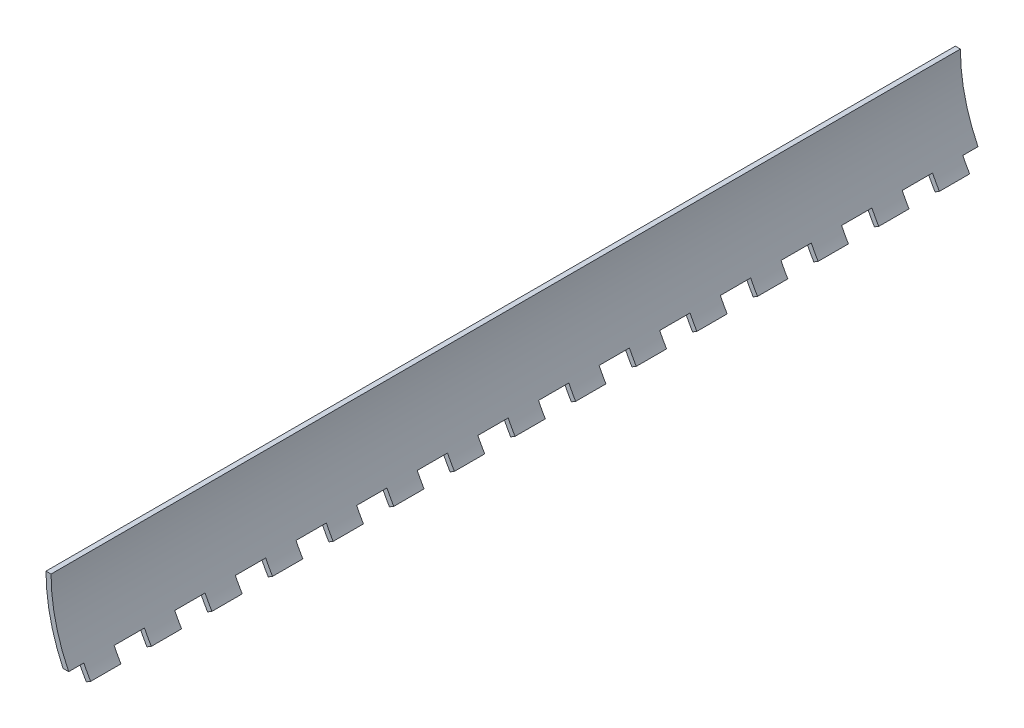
ISO-10303-21;
HEADER;
FILE_DESCRIPTION(('STEP AP214'),'2;1');
FILE_NAME('part.step','',(''),(''),'','','');
FILE_SCHEMA(('AUTOMOTIVE_DESIGN { 1 0 10303 214 1 1 1 1 }'));
ENDSEC;
DATA;
#1=APPLICATION_CONTEXT('core data for automotive mechanical design processes');
#2=APPLICATION_PROTOCOL_DEFINITION('international standard','automotive_design',2000,#1);
#3=PRODUCT_CONTEXT('',#1,'mechanical');
#4=PRODUCT('Part','Part','',(#3));
#5=PRODUCT_RELATED_PRODUCT_CATEGORY('part','',(#4));
#6=PRODUCT_DEFINITION_FORMATION('','',#4);
#7=PRODUCT_DEFINITION_CONTEXT('part definition',#1,'design');
#8=PRODUCT_DEFINITION('design','',#6,#7);
#9=PRODUCT_DEFINITION_SHAPE('','',#8);
#10=(LENGTH_UNIT() NAMED_UNIT(*) SI_UNIT(.MILLI.,.METRE.));
#11=(NAMED_UNIT(*) PLANE_ANGLE_UNIT() SI_UNIT($,.RADIAN.));
#12=(NAMED_UNIT(*) SI_UNIT($,.STERADIAN.) SOLID_ANGLE_UNIT());
#13=UNCERTAINTY_MEASURE_WITH_UNIT(LENGTH_MEASURE(1.E-05),#10,'distance_accuracy_value','');
#14=(GEOMETRIC_REPRESENTATION_CONTEXT(3) GLOBAL_UNCERTAINTY_ASSIGNED_CONTEXT((#13)) GLOBAL_UNIT_ASSIGNED_CONTEXT((#10,
#11,#12)) REPRESENTATION_CONTEXT('',''));
#15=CARTESIAN_POINT('',(0.,0.,0.));
#16=DIRECTION('',(0.,0.,1.));
#17=DIRECTION('',(1.,0.,0.));
#18=AXIS2_PLACEMENT_3D('',#15,#16,#17);
#19=CARTESIAN_POINT('',(5.84095687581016,-17.4857142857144,90.0000000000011));
#20=DIRECTION('',(0.514285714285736,-0.857618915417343,0.));
#21=DIRECTION('',(0.857618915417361,0.514285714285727,0.));
#22=AXIS2_PLACEMENT_3D('',#19,#20,#21);
#23=PLANE('',#22);
#24=DIRECTION('',(0.857618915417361,0.514285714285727,0.));
#25=VECTOR('',#24,1.);
#26=CARTESIAN_POINT('',(5.84095687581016,-17.4857142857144,75.0000000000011));
#27=LINE('',#26,#25);
#28=CARTESIAN_POINT('',(4.98333796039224,-18.,75.0000000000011));
#29=VERTEX_POINT('',#28);
#30=CARTESIAN_POINT('',(5.84095687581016,-17.4857142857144,75.0000000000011));
#31=VERTEX_POINT('',#30);
#32=EDGE_CURVE('E906',#29,#31,#27,.T.);
#33=ORIENTED_EDGE('',*,*,#32,.F.);
#34=DIRECTION('',(0.,0.,-1.00000000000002));
#35=VECTOR('',#34,1.);
#36=CARTESIAN_POINT('',(4.98333796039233,-18.,90.0000000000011));
#37=LINE('',#36,#35);
#38=CARTESIAN_POINT('',(4.98333796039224,-18.,69.0000000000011));
#39=VERTEX_POINT('',#38);
#40=EDGE_CURVE('E806',#29,#39,#37,.T.);
#41=ORIENTED_EDGE('',*,*,#40,.T.);
#42=DIRECTION('',(-0.857618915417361,-0.514285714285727,0.));
#43=VECTOR('',#42,1.);
#44=CARTESIAN_POINT('',(5.84095687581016,-17.4857142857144,69.0000000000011));
#45=LINE('',#44,#43);
#46=CARTESIAN_POINT('',(5.84095687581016,-17.4857142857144,69.0000000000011));
#47=VERTEX_POINT('',#46);
#48=EDGE_CURVE('E898',#47,#39,#45,.T.);
#49=ORIENTED_EDGE('',*,*,#48,.F.);
#50=DIRECTION('',(0.,0.,-1.00000000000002));
#51=VECTOR('',#50,1.);
#52=CARTESIAN_POINT('',(5.84095687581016,-17.4857142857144,90.0000000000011));
#53=LINE('',#52,#51);
#54=EDGE_CURVE('E450',#31,#47,#53,.T.);
#55=ORIENTED_EDGE('',*,*,#54,.F.);
#56=EDGE_LOOP('',(#33,#41,#49,#55));
#57=FACE_BOUND('',#56,.T.);
#58=ADVANCED_FACE('F32',(#57),#23,.T.);
#59=DIRECTION('',(0.857618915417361,0.514285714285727,0.));
#60=VECTOR('',#59,1.);
#61=CARTESIAN_POINT('',(5.84095687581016,-17.4857142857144,63.0000000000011));
#62=LINE('',#61,#60);
#63=CARTESIAN_POINT('',(4.98333796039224,-18.,63.0000000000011));
#64=VERTEX_POINT('',#63);
#65=CARTESIAN_POINT('',(5.84095687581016,-17.4857142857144,63.0000000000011));
#66=VERTEX_POINT('',#65);
#67=EDGE_CURVE('E901',#64,#66,#62,.T.);
#68=ORIENTED_EDGE('',*,*,#67,.F.);
#69=CARTESIAN_POINT('',(4.98333796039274,-18.,57.0000000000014));
#70=VERTEX_POINT('',#69);
#71=EDGE_CURVE('E811',#64,#70,#37,.T.);
#72=ORIENTED_EDGE('',*,*,#71,.T.);
#73=DIRECTION('',(-0.857618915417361,-0.514285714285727,0.));
#74=VECTOR('',#73,1.);
#75=CARTESIAN_POINT('',(5.8409568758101,-17.4857142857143,57.0000000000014));
#76=LINE('',#75,#74);
#77=CARTESIAN_POINT('',(5.8409568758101,-17.4857142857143,57.0000000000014));
#78=VERTEX_POINT('',#77);
#79=EDGE_CURVE('E891',#78,#70,#76,.T.);
#80=ORIENTED_EDGE('',*,*,#79,.F.);
#81=EDGE_CURVE('E457',#66,#78,#53,.T.);
#82=ORIENTED_EDGE('',*,*,#81,.F.);
#83=EDGE_LOOP('',(#68,#72,#80,#82));
#84=FACE_BOUND('',#83,.T.);
#85=ADVANCED_FACE('F941',(#84),#23,.T.);
#86=DIRECTION('',(0.857618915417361,0.514285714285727,0.));
#87=VECTOR('',#86,1.);
#88=CARTESIAN_POINT('',(5.8409568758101,-17.4857142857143,51.0000000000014));
#89=LINE('',#88,#87);
#90=CARTESIAN_POINT('',(4.98333796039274,-18.,51.0000000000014));
#91=VERTEX_POINT('',#90);
#92=CARTESIAN_POINT('',(5.8409568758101,-17.4857142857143,51.0000000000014));
#93=VERTEX_POINT('',#92);
#94=EDGE_CURVE('E894',#91,#93,#89,.T.);
#95=ORIENTED_EDGE('',*,*,#94,.F.);
#96=CARTESIAN_POINT('',(4.98333796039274,-18.,45.0000000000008));
#97=VERTEX_POINT('',#96);
#98=EDGE_CURVE('E1529',#91,#97,#37,.T.);
#99=ORIENTED_EDGE('',*,*,#98,.T.);
#100=DIRECTION('',(-0.857618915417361,-0.514285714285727,0.));
#101=VECTOR('',#100,1.);
#102=CARTESIAN_POINT('',(5.8409568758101,-17.4857142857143,45.0000000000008));
#103=LINE('',#102,#101);
#104=CARTESIAN_POINT('',(5.8409568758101,-17.4857142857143,45.0000000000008));
#105=VERTEX_POINT('',#104);
#106=EDGE_CURVE('E884',#105,#97,#103,.T.);
#107=ORIENTED_EDGE('',*,*,#106,.F.);
#108=EDGE_CURVE('E1559',#93,#105,#53,.T.);
#109=ORIENTED_EDGE('',*,*,#108,.F.);
#110=EDGE_LOOP('',(#95,#99,#107,#109));
#111=FACE_BOUND('',#110,.T.);
#112=ADVANCED_FACE('F946',(#111),#23,.T.);
#113=DIRECTION('',(0.857618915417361,0.514285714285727,0.));
#114=VECTOR('',#113,1.);
#115=CARTESIAN_POINT('',(5.8409568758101,-17.4857142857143,39.0000000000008));
#116=LINE('',#115,#114);
#117=CARTESIAN_POINT('',(4.98333796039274,-18.,39.0000000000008));
#118=VERTEX_POINT('',#117);
#119=CARTESIAN_POINT('',(5.8409568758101,-17.4857142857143,39.0000000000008));
#120=VERTEX_POINT('',#119);
#121=EDGE_CURVE('E887',#118,#120,#116,.T.);
#122=ORIENTED_EDGE('',*,*,#121,.F.);
#123=CARTESIAN_POINT('',(4.98333796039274,-18.,33.0000000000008));
#124=VERTEX_POINT('',#123);
#125=EDGE_CURVE('E1530',#118,#124,#37,.T.);
#126=ORIENTED_EDGE('',*,*,#125,.T.);
#127=DIRECTION('',(-0.857618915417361,-0.514285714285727,0.));
#128=VECTOR('',#127,1.);
#129=CARTESIAN_POINT('',(5.8409568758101,-17.485714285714,33.0000000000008));
#130=LINE('',#129,#128);
#131=CARTESIAN_POINT('',(5.8409568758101,-17.485714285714,33.0000000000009));
#132=VERTEX_POINT('',#131);
#133=EDGE_CURVE('E877',#132,#124,#130,.T.);
#134=ORIENTED_EDGE('',*,*,#133,.F.);
#135=EDGE_CURVE('E1555',#120,#132,#53,.T.);
#136=ORIENTED_EDGE('',*,*,#135,.F.);
#137=EDGE_LOOP('',(#122,#126,#134,#136));
#138=FACE_BOUND('',#137,.T.);
#139=ADVANCED_FACE('F1573',(#138),#23,.T.);
#140=DIRECTION('',(0.857618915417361,0.514285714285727,0.));
#141=VECTOR('',#140,1.);
#142=CARTESIAN_POINT('',(5.8409568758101,-17.485714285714,27.0000000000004));
#143=LINE('',#142,#141);
#144=CARTESIAN_POINT('',(4.98333796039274,-18.,27.0000000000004));
#145=VERTEX_POINT('',#144);
#146=CARTESIAN_POINT('',(5.8409568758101,-17.485714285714,27.0000000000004));
#147=VERTEX_POINT('',#146);
#148=EDGE_CURVE('E880',#145,#147,#143,.T.);
#149=ORIENTED_EDGE('',*,*,#148,.F.);
#150=CARTESIAN_POINT('',(4.98333796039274,-18.,20.9999999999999));
#151=VERTEX_POINT('',#150);
#152=EDGE_CURVE('E1535',#145,#151,#37,.T.);
#153=ORIENTED_EDGE('',*,*,#152,.T.);
#154=DIRECTION('',(-0.857618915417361,-0.514285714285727,0.));
#155=VECTOR('',#154,1.);
#156=CARTESIAN_POINT('',(5.8409568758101,-17.4857142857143,20.9999999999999));
#157=LINE('',#156,#155);
#158=CARTESIAN_POINT('',(5.8409568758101,-17.4857142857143,21.));
#159=VERTEX_POINT('',#158);
#160=EDGE_CURVE('E870',#159,#151,#157,.T.);
#161=ORIENTED_EDGE('',*,*,#160,.F.);
#162=EDGE_CURVE('E1554',#147,#159,#53,.T.);
#163=ORIENTED_EDGE('',*,*,#162,.F.);
#164=EDGE_LOOP('',(#149,#153,#161,#163));
#165=FACE_BOUND('',#164,.T.);
#166=ADVANCED_FACE('F992',(#165),#23,.T.);
#167=DIRECTION('',(0.857618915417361,0.514285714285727,0.));
#168=VECTOR('',#167,1.);
#169=CARTESIAN_POINT('',(5.8409568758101,-17.4857142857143,15.0000000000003));
#170=LINE('',#169,#168);
#171=CARTESIAN_POINT('',(4.98333796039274,-18.,15.0000000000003));
#172=VERTEX_POINT('',#171);
#173=CARTESIAN_POINT('',(5.8409568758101,-17.4857142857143,15.0000000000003));
#174=VERTEX_POINT('',#173);
#175=EDGE_CURVE('E873',#172,#174,#170,.T.);
#176=ORIENTED_EDGE('',*,*,#175,.F.);
#177=CARTESIAN_POINT('',(4.98333796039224,-18.,9.00000000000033));
#178=VERTEX_POINT('',#177);
#179=EDGE_CURVE('E816',#172,#178,#37,.T.);
#180=ORIENTED_EDGE('',*,*,#179,.T.);
#181=DIRECTION('',(-0.857618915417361,-0.514285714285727,0.));
#182=VECTOR('',#181,1.);
#183=CARTESIAN_POINT('',(5.8409568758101,-17.4857142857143,9.00000000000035));
#184=LINE('',#183,#182);
#185=CARTESIAN_POINT('',(5.8409568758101,-17.4857142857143,9.00000000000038));
#186=VERTEX_POINT('',#185);
#187=EDGE_CURVE('E863',#186,#178,#184,.T.);
#188=ORIENTED_EDGE('',*,*,#187,.F.);
#189=EDGE_CURVE('E465',#174,#186,#53,.T.);
#190=ORIENTED_EDGE('',*,*,#189,.F.);
#191=EDGE_LOOP('',(#176,#180,#188,#190));
#192=FACE_BOUND('',#191,.T.);
#193=ADVANCED_FACE('F987',(#192),#23,.T.);
#194=DIRECTION('',(0.857618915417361,0.514285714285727,0.));
#195=VECTOR('',#194,1.);
#196=CARTESIAN_POINT('',(5.8409568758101,-17.4857142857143,3.00000000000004));
#197=LINE('',#196,#195);
#198=CARTESIAN_POINT('',(4.98333796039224,-18.,3.00000000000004));
#199=VERTEX_POINT('',#198);
#200=CARTESIAN_POINT('',(5.8409568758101,-17.4857142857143,3.00000000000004));
#201=VERTEX_POINT('',#200);
#202=EDGE_CURVE('E866',#199,#201,#197,.T.);
#203=ORIENTED_EDGE('',*,*,#202,.F.);
#204=CARTESIAN_POINT('',(4.98333796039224,-18.,-3.00000000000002));
#205=VERTEX_POINT('',#204);
#206=EDGE_CURVE('E456',#199,#205,#37,.T.);
#207=ORIENTED_EDGE('',*,*,#206,.T.);
#208=DIRECTION('',(0.857618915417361,0.514285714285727,0.));
#209=VECTOR('',#208,1.);
#210=CARTESIAN_POINT('',(5.8409568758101,-17.4857142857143,-3.00000000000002));
#211=LINE('',#210,#209);
#212=CARTESIAN_POINT('',(5.8409568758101,-17.4857142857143,-3.00000000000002));
#213=VERTEX_POINT('',#212);
#214=EDGE_CURVE('E521',#205,#213,#211,.T.);
#215=ORIENTED_EDGE('',*,*,#214,.T.);
#216=EDGE_CURVE('E460',#201,#213,#53,.T.);
#217=ORIENTED_EDGE('',*,*,#216,.F.);
#218=EDGE_LOOP('',(#203,#207,#215,#217));
#219=FACE_BOUND('',#218,.T.);
#220=ADVANCED_FACE('F981',(#219),#23,.T.);
#221=CARTESIAN_POINT('',(35.,3.60822483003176E-13,90.0000000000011));
#222=DIRECTION('',(0.,0.,-1.00000000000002));
#223=DIRECTION('',(-1.00000000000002,0.,0.));
#224=AXIS2_PLACEMENT_3D('',#221,#222,#223);
#225=CYLINDRICAL_SURFACE('',#224,35.);
#226=CARTESIAN_POINT('',(4.98333796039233,-18.,87.0000000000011));
#227=VERTEX_POINT('',#226);
#228=CARTESIAN_POINT('',(4.98333796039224,-18.,81.0000000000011));
#229=VERTEX_POINT('',#228);
#230=EDGE_CURVE('E804',#227,#229,#37,.T.);
#231=ORIENTED_EDGE('',*,*,#230,.F.);
#232=CARTESIAN_POINT('',(35.,2.35922392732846E-13,87.0000000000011));
#233=DIRECTION('',(0.,0.,-1.00000000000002));
#234=DIRECTION('',(-1.00000000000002,0.,0.));
#235=AXIS2_PLACEMENT_3D('',#232,#233,#234);
#236=CIRCLE('',#235,35.);
#237=CARTESIAN_POINT('',(3.37722339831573,-14.9999999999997,87.0000000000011));
#238=VERTEX_POINT('',#237);
#239=EDGE_CURVE('E438',#227,#238,#236,.T.);
#240=ORIENTED_EDGE('',*,*,#239,.T.);
#241=DIRECTION('',(0.,0.,-1.00000000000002));
#242=VECTOR('',#241,1.);
#243=CARTESIAN_POINT('',(3.37722339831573,-14.9999999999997,90.0000000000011));
#244=LINE('',#243,#242);
#245=CARTESIAN_POINT('',(3.37722339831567,-14.9999999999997,90.0000000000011));
#246=VERTEX_POINT('',#245);
#247=EDGE_CURVE('E443',#238,#246,#244,.F.);
#248=ORIENTED_EDGE('',*,*,#247,.T.);
#249=CARTESIAN_POINT('',(35.,3.60822483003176E-13,90.0000000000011));
#250=DIRECTION('',(0.,0.,1.00000000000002));
#251=DIRECTION('',(1.00000000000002,0.,0.));
#252=AXIS2_PLACEMENT_3D('',#249,#250,#251);
#253=CIRCLE('',#252,35.);
#254=CARTESIAN_POINT('',(0.,0.,90.0000000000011));
#255=VERTEX_POINT('',#254);
#256=EDGE_CURVE('E507',#255,#246,#253,.T.);
#257=ORIENTED_EDGE('',*,*,#256,.F.);
#258=DIRECTION('',(0.,0.,-1.00000000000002));
#259=VECTOR('',#258,1.);
#260=CARTESIAN_POINT('',(0.,0.,90.0000000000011));
#261=LINE('',#260,#259);
#262=CARTESIAN_POINT('',(0.,0.,-90.0000000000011));
#263=VERTEX_POINT('',#262);
#264=EDGE_CURVE('E496',#255,#263,#261,.T.);
#265=ORIENTED_EDGE('',*,*,#264,.T.);
#266=CARTESIAN_POINT('',(34.9999999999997,0.,-90.0000000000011));
#267=DIRECTION('',(0.,0.,1.00000000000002));
#268=DIRECTION('',(1.00000000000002,0.,0.));
#269=AXIS2_PLACEMENT_3D('',#266,#267,#268);
#270=CIRCLE('',#269,35.);
#271=CARTESIAN_POINT('',(3.37722339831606,-15.,-90.0000000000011));
#272=VERTEX_POINT('',#271);
#273=EDGE_CURVE('E516',#263,#272,#270,.T.);
#274=ORIENTED_EDGE('',*,*,#273,.T.);
#275=DIRECTION('',(0.,0.,-1.00000000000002));
#276=VECTOR('',#275,1.);
#277=CARTESIAN_POINT('',(3.37722339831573,-14.9999999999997,90.0000000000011));
#278=LINE('',#277,#276);
#279=CARTESIAN_POINT('',(3.37722339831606,-15.,-87.0000000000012));
#280=VERTEX_POINT('',#279);
#281=EDGE_CURVE('E650',#280,#272,#278,.T.);
#282=ORIENTED_EDGE('',*,*,#281,.F.);
#283=CARTESIAN_POINT('',(34.9999999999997,2.0122792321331E-13,-87.0000000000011));
#284=DIRECTION('',(0.,0.,-1.00000000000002));
#285=DIRECTION('',(-1.00000000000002,0.,0.));
#286=AXIS2_PLACEMENT_3D('',#283,#284,#285);
#287=CIRCLE('',#286,35.);
#288=CARTESIAN_POINT('',(4.98333796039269,-17.9999999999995,-87.0000000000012));
#289=VERTEX_POINT('',#288);
#290=EDGE_CURVE('E645',#289,#280,#287,.T.);
#291=ORIENTED_EDGE('',*,*,#290,.F.);
#292=CARTESIAN_POINT('',(4.98333796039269,-17.9999999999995,-81.0000000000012));
#293=VERTEX_POINT('',#292);
#294=EDGE_CURVE('E449',#293,#289,#37,.T.);
#295=ORIENTED_EDGE('',*,*,#294,.F.);
#296=CARTESIAN_POINT('',(34.9999999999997,0.,-81.0000000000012));
#297=DIRECTION('',(0.,0.,1.00000000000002));
#298=DIRECTION('',(1.00000000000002,0.,0.));
#299=AXIS2_PLACEMENT_3D('',#296,#297,#298);
#300=CIRCLE('',#299,35.);
#301=CARTESIAN_POINT('',(3.37722339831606,-15.,-81.0000000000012));
#302=VERTEX_POINT('',#301);
#303=EDGE_CURVE('E632',#302,#293,#300,.T.);
#304=ORIENTED_EDGE('',*,*,#303,.F.);
#305=DIRECTION('',(0.,0.,-1.00000000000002));
#306=VECTOR('',#305,1.);
#307=CARTESIAN_POINT('',(3.37722339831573,-14.9999999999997,90.0000000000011));
#308=LINE('',#307,#306);
#309=CARTESIAN_POINT('',(3.37722339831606,-14.9999999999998,-75.0000000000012));
#310=VERTEX_POINT('',#309);
#311=EDGE_CURVE('E637',#310,#302,#308,.T.);
#312=ORIENTED_EDGE('',*,*,#311,.F.);
#313=CARTESIAN_POINT('',(34.9999999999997,0.,-75.0000000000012));
#314=DIRECTION('',(0.,0.,-1.00000000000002));
#315=DIRECTION('',(-1.00000000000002,0.,0.));
#316=AXIS2_PLACEMENT_3D('',#313,#314,#315);
#317=CIRCLE('',#316,35.);
#318=CARTESIAN_POINT('',(4.98333796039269,-17.9999999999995,-75.0000000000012));
#319=VERTEX_POINT('',#318);
#320=EDGE_CURVE('E627',#319,#310,#317,.T.);
#321=ORIENTED_EDGE('',*,*,#320,.F.);
#322=CARTESIAN_POINT('',(4.98333796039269,-17.9999999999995,-69.0000000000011));
#323=VERTEX_POINT('',#322);
#324=EDGE_CURVE('E454',#323,#319,#37,.T.);
#325=ORIENTED_EDGE('',*,*,#324,.F.);
#326=CARTESIAN_POINT('',(34.9999999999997,0.,-69.0000000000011));
#327=DIRECTION('',(0.,0.,1.00000000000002));
#328=DIRECTION('',(1.00000000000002,0.,0.));
#329=AXIS2_PLACEMENT_3D('',#326,#327,#328);
#330=CIRCLE('',#329,35.);
#331=CARTESIAN_POINT('',(3.37722339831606,-14.9999999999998,-69.0000000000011));
#332=VERTEX_POINT('',#331);
#333=EDGE_CURVE('E614',#332,#323,#330,.T.);
#334=ORIENTED_EDGE('',*,*,#333,.F.);
#335=DIRECTION('',(0.,0.,-1.00000000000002));
#336=VECTOR('',#335,1.);
#337=CARTESIAN_POINT('',(3.37722339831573,-14.9999999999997,90.0000000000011));
#338=LINE('',#337,#336);
#339=CARTESIAN_POINT('',(3.37722339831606,-14.9999999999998,-63.0000000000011));
#340=VERTEX_POINT('',#339);
#341=EDGE_CURVE('E619',#340,#332,#338,.T.);
#342=ORIENTED_EDGE('',*,*,#341,.F.);
#343=CARTESIAN_POINT('',(34.9999999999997,0.,-63.0000000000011));
#344=DIRECTION('',(0.,0.,-1.00000000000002));
#345=DIRECTION('',(-1.00000000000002,0.,0.));
#346=AXIS2_PLACEMENT_3D('',#343,#344,#345);
#347=CIRCLE('',#346,35.);
#348=CARTESIAN_POINT('',(4.98333796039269,-17.9999999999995,-63.0000000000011));
#349=VERTEX_POINT('',#348);
#350=EDGE_CURVE('E609',#349,#340,#347,.T.);
#351=ORIENTED_EDGE('',*,*,#350,.F.);
#352=CARTESIAN_POINT('',(4.98333796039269,-18.,-57.0000000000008));
#353=VERTEX_POINT('',#352);
#354=EDGE_CURVE('E826',#353,#349,#37,.T.);
#355=ORIENTED_EDGE('',*,*,#354,.F.);
#356=CARTESIAN_POINT('',(35.,2.98372437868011E-13,-57.0000000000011));
#357=DIRECTION('',(0.,0.,1.00000000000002));
#358=DIRECTION('',(1.00000000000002,0.,0.));
#359=AXIS2_PLACEMENT_3D('',#356,#357,#358);
#360=CIRCLE('',#359,35.);
#361=CARTESIAN_POINT('',(3.37722339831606,-14.9999999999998,-57.0000000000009));
#362=VERTEX_POINT('',#361);
#363=EDGE_CURVE('E596',#362,#353,#360,.T.);
#364=ORIENTED_EDGE('',*,*,#363,.F.);
#365=DIRECTION('',(0.,0.,-1.00000000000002));
#366=VECTOR('',#365,1.);
#367=CARTESIAN_POINT('',(3.37722339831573,-14.9999999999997,90.0000000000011));
#368=LINE('',#367,#366);
#369=CARTESIAN_POINT('',(3.37722339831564,-15.,-51.0000000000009));
#370=VERTEX_POINT('',#369);
#371=EDGE_CURVE('E601',#370,#362,#368,.T.);
#372=ORIENTED_EDGE('',*,*,#371,.F.);
#373=CARTESIAN_POINT('',(35.,2.98372437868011E-13,-51.0000000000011));
#374=DIRECTION('',(0.,0.,-1.00000000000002));
#375=DIRECTION('',(-1.00000000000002,0.,0.));
#376=AXIS2_PLACEMENT_3D('',#373,#374,#375);
#377=CIRCLE('',#376,35.);
#378=CARTESIAN_POINT('',(4.98333796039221,-18.,-51.0000000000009));
#379=VERTEX_POINT('',#378);
#380=EDGE_CURVE('E591',#379,#370,#377,.T.);
#381=ORIENTED_EDGE('',*,*,#380,.F.);
#382=CARTESIAN_POINT('',(4.98333796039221,-18.,-45.0000000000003));
#383=VERTEX_POINT('',#382);
#384=EDGE_CURVE('E822',#383,#379,#37,.T.);
#385=ORIENTED_EDGE('',*,*,#384,.F.);
#386=CARTESIAN_POINT('',(35.,3.05311331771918E-13,-45.0000000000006));
#387=DIRECTION('',(0.,0.,1.00000000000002));
#388=DIRECTION('',(1.00000000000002,0.,0.));
#389=AXIS2_PLACEMENT_3D('',#386,#387,#388);
#390=CIRCLE('',#389,35.);
#391=CARTESIAN_POINT('',(3.37722339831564,-15.,-45.0000000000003));
#392=VERTEX_POINT('',#391);
#393=EDGE_CURVE('E578',#392,#383,#390,.T.);
#394=ORIENTED_EDGE('',*,*,#393,.F.);
#395=DIRECTION('',(0.,0.,-1.00000000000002));
#396=VECTOR('',#395,1.);
#397=CARTESIAN_POINT('',(3.37722339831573,-14.9999999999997,90.0000000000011));
#398=LINE('',#397,#396);
#399=CARTESIAN_POINT('',(3.37722339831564,-15.,-39.0000000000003));
#400=VERTEX_POINT('',#399);
#401=EDGE_CURVE('E583',#400,#392,#398,.T.);
#402=ORIENTED_EDGE('',*,*,#401,.F.);
#403=CARTESIAN_POINT('',(35.,3.05311331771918E-13,-39.0000000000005));
#404=DIRECTION('',(0.,0.,-1.00000000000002));
#405=DIRECTION('',(-1.00000000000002,0.,0.));
#406=AXIS2_PLACEMENT_3D('',#403,#404,#405);
#407=CIRCLE('',#406,35.);
#408=CARTESIAN_POINT('',(4.98333796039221,-18.,-39.0000000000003));
#409=VERTEX_POINT('',#408);
#410=EDGE_CURVE('E573',#409,#400,#407,.T.);
#411=ORIENTED_EDGE('',*,*,#410,.F.);
#412=CARTESIAN_POINT('',(4.98333796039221,-18.,-33.0000000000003));
#413=VERTEX_POINT('',#412);
#414=EDGE_CURVE('E818',#413,#409,#37,.T.);
#415=ORIENTED_EDGE('',*,*,#414,.F.);
#416=CARTESIAN_POINT('',(35.,2.35922392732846E-13,-33.0000000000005));
#417=DIRECTION('',(0.,0.,1.00000000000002));
#418=DIRECTION('',(1.00000000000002,0.,0.));
#419=AXIS2_PLACEMENT_3D('',#416,#417,#418);
#420=CIRCLE('',#419,35.);
#421=CARTESIAN_POINT('',(3.37722339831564,-15.,-33.0000000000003));
#422=VERTEX_POINT('',#421);
#423=EDGE_CURVE('E560',#422,#413,#420,.T.);
#424=ORIENTED_EDGE('',*,*,#423,.F.);
#425=DIRECTION('',(0.,0.,-1.00000000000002));
#426=VECTOR('',#425,1.);
#427=CARTESIAN_POINT('',(3.37722339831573,-14.9999999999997,90.0000000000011));
#428=LINE('',#427,#426);
#429=CARTESIAN_POINT('',(3.37722339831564,-15.,-27.0000000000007));
#430=VERTEX_POINT('',#429);
#431=EDGE_CURVE('E565',#430,#422,#428,.T.);
#432=ORIENTED_EDGE('',*,*,#431,.F.);
#433=CARTESIAN_POINT('',(35.,2.35922392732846E-13,-27.0000000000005));
#434=DIRECTION('',(0.,0.,-1.00000000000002));
#435=DIRECTION('',(-1.00000000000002,0.,0.));
#436=AXIS2_PLACEMENT_3D('',#433,#434,#435);
#437=CIRCLE('',#436,35.);
#438=CARTESIAN_POINT('',(4.98333796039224,-18.,-27.0000000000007));
#439=VERTEX_POINT('',#438);
#440=EDGE_CURVE('E555',#439,#430,#437,.T.);
#441=ORIENTED_EDGE('',*,*,#440,.F.);
#442=CARTESIAN_POINT('',(4.98333796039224,-18.,-21.0000000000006));
#443=VERTEX_POINT('',#442);
#444=EDGE_CURVE('E813',#443,#439,#37,.T.);
#445=ORIENTED_EDGE('',*,*,#444,.F.);
#446=CARTESIAN_POINT('',(35.,2.35922392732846E-13,-21.0000000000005));
#447=DIRECTION('',(0.,0.,1.00000000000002));
#448=DIRECTION('',(1.00000000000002,0.,0.));
#449=AXIS2_PLACEMENT_3D('',#446,#447,#448);
#450=CIRCLE('',#449,35.);
#451=CARTESIAN_POINT('',(3.37722339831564,-14.9999999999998,-21.0000000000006));
#452=VERTEX_POINT('',#451);
#453=EDGE_CURVE('E542',#452,#443,#450,.T.);
#454=ORIENTED_EDGE('',*,*,#453,.F.);
#455=DIRECTION('',(0.,0.,-1.00000000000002));
#456=VECTOR('',#455,1.);
#457=CARTESIAN_POINT('',(3.37722339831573,-14.9999999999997,90.0000000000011));
#458=LINE('',#457,#456);
#459=CARTESIAN_POINT('',(3.37722339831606,-14.9999999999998,-15.0000000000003));
#460=VERTEX_POINT('',#459);
#461=EDGE_CURVE('E547',#460,#452,#458,.T.);
#462=ORIENTED_EDGE('',*,*,#461,.F.);
#463=CARTESIAN_POINT('',(35.,2.35922392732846E-13,-15.0000000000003));
#464=DIRECTION('',(0.,0.,-1.00000000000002));
#465=DIRECTION('',(-1.00000000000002,0.,0.));
#466=AXIS2_PLACEMENT_3D('',#463,#464,#465);
#467=CIRCLE('',#466,35.);
#468=CARTESIAN_POINT('',(4.98333796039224,-18.,-15.0000000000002));
#469=VERTEX_POINT('',#468);
#470=EDGE_CURVE('E537',#469,#460,#467,.T.);
#471=ORIENTED_EDGE('',*,*,#470,.F.);
#472=CARTESIAN_POINT('',(4.98333796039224,-18.,-8.99999999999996));
#473=VERTEX_POINT('',#472);
#474=EDGE_CURVE('E807',#473,#469,#37,.T.);
#475=ORIENTED_EDGE('',*,*,#474,.F.);
#476=CARTESIAN_POINT('',(35.,2.35922392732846E-13,-9.00000000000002));
#477=DIRECTION('',(0.,0.,1.00000000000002));
#478=DIRECTION('',(1.00000000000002,0.,0.));
#479=AXIS2_PLACEMENT_3D('',#476,#477,#478);
#480=CIRCLE('',#479,35.);
#481=CARTESIAN_POINT('',(3.37722339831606,-14.9999999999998,-9.00000000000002));
#482=VERTEX_POINT('',#481);
#483=EDGE_CURVE('E524',#482,#473,#480,.T.);
#484=ORIENTED_EDGE('',*,*,#483,.F.);
#485=DIRECTION('',(0.,0.,-1.00000000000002));
#486=VECTOR('',#485,1.);
#487=CARTESIAN_POINT('',(3.37722339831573,-14.9999999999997,90.0000000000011));
#488=LINE('',#487,#486);
#489=CARTESIAN_POINT('',(3.37722339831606,-15.,-3.00000000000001));
#490=VERTEX_POINT('',#489);
#491=EDGE_CURVE('E529',#490,#482,#488,.T.);
#492=ORIENTED_EDGE('',*,*,#491,.F.);
#493=CARTESIAN_POINT('',(35.,2.35922392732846E-13,-3.00000000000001));
#494=DIRECTION('',(0.,0.,-1.00000000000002));
#495=DIRECTION('',(-1.00000000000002,0.,0.));
#496=AXIS2_PLACEMENT_3D('',#493,#494,#495);
#497=CIRCLE('',#496,35.);
#498=EDGE_CURVE('E519',#205,#490,#497,.T.);
#499=ORIENTED_EDGE('',*,*,#498,.F.);
#500=ORIENTED_EDGE('',*,*,#206,.F.);
#501=CARTESIAN_POINT('',(35.,2.35922392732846E-13,3.00000000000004));
#502=DIRECTION('',(0.,0.,-1.00000000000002));
#503=DIRECTION('',(-1.00000000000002,0.,0.));
#504=AXIS2_PLACEMENT_3D('',#501,#502,#503);
#505=CIRCLE('',#504,35.);
#506=CARTESIAN_POINT('',(3.37722339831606,-15.,3.00000000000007));
#507=VERTEX_POINT('',#506);
#508=EDGE_CURVE('E661',#199,#507,#505,.T.);
#509=ORIENTED_EDGE('',*,*,#508,.T.);
#510=DIRECTION('',(0.,0.,-1.00000000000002));
#511=VECTOR('',#510,1.);
#512=CARTESIAN_POINT('',(3.37722339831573,-14.9999999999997,90.0000000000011));
#513=LINE('',#512,#511);
#514=CARTESIAN_POINT('',(3.37722339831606,-15.,9.00000000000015));
#515=VERTEX_POINT('',#514);
#516=EDGE_CURVE('E658',#507,#515,#513,.F.);
#517=ORIENTED_EDGE('',*,*,#516,.T.);
#518=CARTESIAN_POINT('',(35.,2.35922392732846E-13,9.00000000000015));
#519=DIRECTION('',(0.,0.,1.00000000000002));
#520=DIRECTION('',(1.00000000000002,0.,0.));
#521=AXIS2_PLACEMENT_3D('',#518,#519,#520);
#522=CIRCLE('',#521,35.);
#523=EDGE_CURVE('E666',#515,#178,#522,.T.);
#524=ORIENTED_EDGE('',*,*,#523,.T.);
#525=ORIENTED_EDGE('',*,*,#179,.F.);
#526=CARTESIAN_POINT('',(35.,3.60822483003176E-13,15.0000000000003));
#527=DIRECTION('',(0.,0.,-1.00000000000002));
#528=DIRECTION('',(-1.00000000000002,0.,0.));
#529=AXIS2_PLACEMENT_3D('',#526,#527,#528);
#530=CIRCLE('',#529,35.);
#531=CARTESIAN_POINT('',(3.37722339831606,-15.,15.0000000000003));
#532=VERTEX_POINT('',#531);
#533=EDGE_CURVE('E681',#172,#532,#530,.T.);
#534=ORIENTED_EDGE('',*,*,#533,.T.);
#535=DIRECTION('',(0.,0.,-1.00000000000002));
#536=VECTOR('',#535,1.);
#537=CARTESIAN_POINT('',(3.37722339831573,-14.9999999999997,90.0000000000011));
#538=LINE('',#537,#536);
#539=CARTESIAN_POINT('',(3.37722339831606,-15.,20.9999999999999));
#540=VERTEX_POINT('',#539);
#541=EDGE_CURVE('E678',#532,#540,#538,.F.);
#542=ORIENTED_EDGE('',*,*,#541,.T.);
#543=CARTESIAN_POINT('',(35.,2.35922392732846E-13,21.));
#544=DIRECTION('',(0.,0.,1.00000000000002));
#545=DIRECTION('',(1.00000000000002,0.,0.));
#546=AXIS2_PLACEMENT_3D('',#543,#544,#545);
#547=CIRCLE('',#546,35.);
#548=EDGE_CURVE('E686',#540,#151,#547,.T.);
#549=ORIENTED_EDGE('',*,*,#548,.T.);
#550=ORIENTED_EDGE('',*,*,#152,.F.);
#551=CARTESIAN_POINT('',(35.,2.35922392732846E-13,27.0000000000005));
#552=DIRECTION('',(0.,0.,-1.00000000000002));
#553=DIRECTION('',(-1.00000000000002,0.,0.));
#554=AXIS2_PLACEMENT_3D('',#551,#552,#553);
#555=CIRCLE('',#554,35.);
#556=CARTESIAN_POINT('',(3.37722339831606,-14.9999999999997,27.0000000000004));
#557=VERTEX_POINT('',#556);
#558=EDGE_CURVE('E701',#145,#557,#555,.T.);
#559=ORIENTED_EDGE('',*,*,#558,.T.);
#560=DIRECTION('',(0.,0.,-1.00000000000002));
#561=VECTOR('',#560,1.);
#562=CARTESIAN_POINT('',(3.37722339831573,-14.9999999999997,90.0000000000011));
#563=LINE('',#562,#561);
#564=CARTESIAN_POINT('',(3.37722339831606,-14.9999999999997,33.0000000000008));
#565=VERTEX_POINT('',#564);
#566=EDGE_CURVE('E698',#557,#565,#563,.F.);
#567=ORIENTED_EDGE('',*,*,#566,.T.);
#568=CARTESIAN_POINT('',(35.,0.,33.0000000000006));
#569=DIRECTION('',(0.,0.,1.00000000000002));
#570=DIRECTION('',(1.00000000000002,0.,0.));
#571=AXIS2_PLACEMENT_3D('',#568,#569,#570);
#572=CIRCLE('',#571,35.);
#573=EDGE_CURVE('E706',#565,#124,#572,.T.);
#574=ORIENTED_EDGE('',*,*,#573,.T.);
#575=ORIENTED_EDGE('',*,*,#125,.F.);
#576=CARTESIAN_POINT('',(35.,1.04083408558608E-13,39.0000000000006));
#577=DIRECTION('',(0.,0.,-1.00000000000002));
#578=DIRECTION('',(-1.00000000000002,0.,0.));
#579=AXIS2_PLACEMENT_3D('',#576,#577,#578);
#580=CIRCLE('',#579,35.);
#581=CARTESIAN_POINT('',(3.37722339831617,-14.9999999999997,39.0000000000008));
#582=VERTEX_POINT('',#581);
#583=EDGE_CURVE('E721',#118,#582,#580,.T.);
#584=ORIENTED_EDGE('',*,*,#583,.T.);
#585=DIRECTION('',(0.,0.,-1.00000000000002));
#586=VECTOR('',#585,1.);
#587=CARTESIAN_POINT('',(3.37722339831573,-14.9999999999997,90.0000000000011));
#588=LINE('',#587,#586);
#589=CARTESIAN_POINT('',(3.37722339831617,-15.,45.0000000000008));
#590=VERTEX_POINT('',#589);
#591=EDGE_CURVE('E718',#582,#590,#588,.F.);
#592=ORIENTED_EDGE('',*,*,#591,.T.);
#593=CARTESIAN_POINT('',(35.,0.,45.0000000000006));
#594=DIRECTION('',(0.,0.,1.00000000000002));
#595=DIRECTION('',(1.00000000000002,0.,0.));
#596=AXIS2_PLACEMENT_3D('',#593,#594,#595);
#597=CIRCLE('',#596,35.);
#598=EDGE_CURVE('E726',#590,#97,#597,.T.);
#599=ORIENTED_EDGE('',*,*,#598,.T.);
#600=ORIENTED_EDGE('',*,*,#98,.F.);
#601=CARTESIAN_POINT('',(35.,0.,51.0000000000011));
#602=DIRECTION('',(0.,0.,-1.00000000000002));
#603=DIRECTION('',(-1.00000000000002,0.,0.));
#604=AXIS2_PLACEMENT_3D('',#601,#602,#603);
#605=CIRCLE('',#604,35.);
#606=CARTESIAN_POINT('',(3.3772233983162,-15.,51.0000000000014));
#607=VERTEX_POINT('',#606);
#608=EDGE_CURVE('E741',#91,#607,#605,.T.);
#609=ORIENTED_EDGE('',*,*,#608,.T.);
#610=DIRECTION('',(0.,0.,-1.00000000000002));
#611=VECTOR('',#610,1.);
#612=CARTESIAN_POINT('',(3.37722339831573,-14.9999999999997,90.0000000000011));
#613=LINE('',#612,#611);
#614=CARTESIAN_POINT('',(3.3772233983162,-15.,57.0000000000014));
#615=VERTEX_POINT('',#614);
#616=EDGE_CURVE('E738',#607,#615,#613,.F.);
#617=ORIENTED_EDGE('',*,*,#616,.T.);
#618=CARTESIAN_POINT('',(35.,0.,57.0000000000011));
#619=DIRECTION('',(0.,0.,1.00000000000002));
#620=DIRECTION('',(1.00000000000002,0.,0.));
#621=AXIS2_PLACEMENT_3D('',#618,#619,#620);
#622=CIRCLE('',#621,35.);
#623=EDGE_CURVE('E746',#615,#70,#622,.T.);
#624=ORIENTED_EDGE('',*,*,#623,.T.);
#625=ORIENTED_EDGE('',*,*,#71,.F.);
#626=CARTESIAN_POINT('',(35.,1.04083408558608E-13,63.0000000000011));
#627=DIRECTION('',(0.,0.,-1.00000000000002));
#628=DIRECTION('',(-1.00000000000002,0.,0.));
#629=AXIS2_PLACEMENT_3D('',#626,#627,#628);
#630=CIRCLE('',#629,35.);
#631=CARTESIAN_POINT('',(3.3772233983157,-15.,63.0000000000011));
#632=VERTEX_POINT('',#631);
#633=EDGE_CURVE('E761',#64,#632,#630,.T.);
#634=ORIENTED_EDGE('',*,*,#633,.T.);
#635=DIRECTION('',(0.,0.,-1.00000000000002));
#636=VECTOR('',#635,1.);
#637=CARTESIAN_POINT('',(3.37722339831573,-14.9999999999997,90.0000000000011));
#638=LINE('',#637,#636);
#639=CARTESIAN_POINT('',(3.37722339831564,-15.,69.0000000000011));
#640=VERTEX_POINT('',#639);
#641=EDGE_CURVE('E758',#632,#640,#638,.F.);
#642=ORIENTED_EDGE('',*,*,#641,.T.);
#643=CARTESIAN_POINT('',(35.,2.28983498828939E-13,69.0000000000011));
#644=DIRECTION('',(0.,0.,1.00000000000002));
#645=DIRECTION('',(1.00000000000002,0.,0.));
#646=AXIS2_PLACEMENT_3D('',#643,#644,#645);
#647=CIRCLE('',#646,35.);
#648=EDGE_CURVE('E766',#640,#39,#647,.T.);
#649=ORIENTED_EDGE('',*,*,#648,.T.);
#650=ORIENTED_EDGE('',*,*,#40,.F.);
#651=CARTESIAN_POINT('',(35.,2.28983498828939E-13,75.0000000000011));
#652=DIRECTION('',(0.,0.,-1.00000000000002));
#653=DIRECTION('',(-1.00000000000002,0.,0.));
#654=AXIS2_PLACEMENT_3D('',#651,#652,#653);
#655=CIRCLE('',#654,35.);
#656=CARTESIAN_POINT('',(3.3772233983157,-15.,75.0000000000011));
#657=VERTEX_POINT('',#656);
#658=EDGE_CURVE('E781',#29,#657,#655,.T.);
#659=ORIENTED_EDGE('',*,*,#658,.T.);
#660=DIRECTION('',(0.,0.,-1.00000000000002));
#661=VECTOR('',#660,1.);
#662=CARTESIAN_POINT('',(3.37722339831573,-14.9999999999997,90.0000000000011));
#663=LINE('',#662,#661);
#664=CARTESIAN_POINT('',(3.37722339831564,-14.9999999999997,81.0000000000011));
#665=VERTEX_POINT('',#664);
#666=EDGE_CURVE('E778',#657,#665,#663,.F.);
#667=ORIENTED_EDGE('',*,*,#666,.T.);
#668=CARTESIAN_POINT('',(35.,2.35922392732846E-13,81.0000000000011));
#669=DIRECTION('',(0.,0.,1.00000000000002));
#670=DIRECTION('',(1.00000000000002,0.,0.));
#671=AXIS2_PLACEMENT_3D('',#668,#669,#670);
#672=CIRCLE('',#671,35.);
#673=EDGE_CURVE('E786',#665,#229,#672,.T.);
#674=ORIENTED_EDGE('',*,*,#673,.T.);
#675=EDGE_LOOP('',(#231,#240,#248,#257,#265,#274,#282,#291,#295,#304,#312,#321,#325,#334,#342,
#351,#355,#364,#372,#381,#385,#394,#402,#411,#415,#424,#432,#441,#445,#454,#462,#471,#475,#484,
#492,#499,#500,#509,#517,#524,#525,#534,#542,#549,#550,#559,#567,#574,#575,#584,#592,#599,#600,
#609,#617,#624,#625,#634,#642,#649,#650,#659,#667,#674));
#676=FACE_BOUND('',#675,.T.);
#677=ADVANCED_FACE('F34',(#676),#225,.T.);
#678=ORIENTED_EDGE('',*,*,#294,.T.);
#679=DIRECTION('',(0.857618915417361,0.514285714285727,0.));
#680=VECTOR('',#679,1.);
#681=CARTESIAN_POINT('',(5.8409568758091,-17.4857142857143,-87.0000000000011));
#682=LINE('',#681,#680);
#683=CARTESIAN_POINT('',(5.8409568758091,-17.4857142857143,-87.0000000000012));
#684=VERTEX_POINT('',#683);
#685=EDGE_CURVE('E647',#289,#684,#682,.T.);
#686=ORIENTED_EDGE('',*,*,#685,.T.);
#687=CARTESIAN_POINT('',(5.8409568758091,-17.4857142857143,-81.0000000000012));
#688=VERTEX_POINT('',#687);
#689=EDGE_CURVE('E466',#688,#684,#53,.T.);
#690=ORIENTED_EDGE('',*,*,#689,.F.);
#691=DIRECTION('',(-0.857618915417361,-0.514285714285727,0.));
#692=VECTOR('',#691,1.);
#693=CARTESIAN_POINT('',(5.8409568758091,-17.4857142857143,-81.0000000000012));
#694=LINE('',#693,#692);
#695=EDGE_CURVE('E634',#688,#293,#694,.T.);
#696=ORIENTED_EDGE('',*,*,#695,.T.);
#697=EDGE_LOOP('',(#678,#686,#690,#696));
#698=FACE_BOUND('',#697,.T.);
#699=ADVANCED_FACE('F928',(#698),#23,.T.);
#700=CARTESIAN_POINT('',(35.,3.60822483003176E-13,90.0000000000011));
#701=DIRECTION('',(0.,0.,-1.00000000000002));
#702=DIRECTION('',(-1.00000000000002,0.,0.));
#703=AXIS2_PLACEMENT_3D('',#700,#701,#702);
#704=CYLINDRICAL_SURFACE('',#703,34.);
#705=CARTESIAN_POINT('',(35.,2.35922392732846E-13,87.0000000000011));
#706=DIRECTION('',(0.,0.,-1.00000000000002));
#707=DIRECTION('',(-1.00000000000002,0.,0.));
#708=AXIS2_PLACEMENT_3D('',#705,#706,#707);
#709=CIRCLE('',#708,34.);
#710=CARTESIAN_POINT('',(5.84095687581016,-17.4857142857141,87.0000000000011));
#711=VERTEX_POINT('',#710);
#712=CARTESIAN_POINT('',(4.48770739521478,-15.,87.0000000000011));
#713=VERTEX_POINT('',#712);
#714=EDGE_CURVE('E436',#711,#713,#709,.T.);
#715=ORIENTED_EDGE('',*,*,#714,.F.);
#716=CARTESIAN_POINT('',(5.84095687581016,-17.4857142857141,81.0000000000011));
#717=VERTEX_POINT('',#716);
#718=EDGE_CURVE('E55',#711,#717,#53,.T.);
#719=ORIENTED_EDGE('',*,*,#718,.T.);
#720=CARTESIAN_POINT('',(35.,2.35922392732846E-13,81.0000000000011));
#721=DIRECTION('',(0.,0.,1.00000000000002));
#722=DIRECTION('',(1.00000000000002,0.,0.));
#723=AXIS2_PLACEMENT_3D('',#720,#721,#722);
#724=CIRCLE('',#723,34.);
#725=CARTESIAN_POINT('',(4.48770739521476,-15.,81.0000000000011));
#726=VERTEX_POINT('',#725);
#727=EDGE_CURVE('E789',#726,#717,#724,.T.);
#728=ORIENTED_EDGE('',*,*,#727,.F.);
#729=DIRECTION('',(0.,0.,-1.00000000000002));
#730=VECTOR('',#729,1.);
#731=CARTESIAN_POINT('',(4.48770739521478,-15.,90.0000000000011));
#732=LINE('',#731,#730);
#733=CARTESIAN_POINT('',(4.48770739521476,-15.,75.0000000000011));
#734=VERTEX_POINT('',#733);
#735=EDGE_CURVE('E908',#734,#726,#732,.F.);
#736=ORIENTED_EDGE('',*,*,#735,.F.);
#737=CARTESIAN_POINT('',(35.,2.28983498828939E-13,75.0000000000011));
#738=DIRECTION('',(0.,0.,-1.00000000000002));
#739=DIRECTION('',(-1.00000000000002,0.,0.));
#740=AXIS2_PLACEMENT_3D('',#737,#738,#739);
#741=CIRCLE('',#740,34.);
#742=EDGE_CURVE('E784',#31,#734,#741,.T.);
#743=ORIENTED_EDGE('',*,*,#742,.F.);
#744=ORIENTED_EDGE('',*,*,#54,.T.);
#745=CARTESIAN_POINT('',(35.,2.28983498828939E-13,69.0000000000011));
#746=DIRECTION('',(0.,0.,1.00000000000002));
#747=DIRECTION('',(1.00000000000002,0.,0.));
#748=AXIS2_PLACEMENT_3D('',#745,#746,#747);
#749=CIRCLE('',#748,34.);
#750=CARTESIAN_POINT('',(4.48770739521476,-15.,69.0000000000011));
#751=VERTEX_POINT('',#750);
#752=EDGE_CURVE('E769',#751,#47,#749,.T.);
#753=ORIENTED_EDGE('',*,*,#752,.F.);
#754=DIRECTION('',(0.,0.,-1.00000000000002));
#755=VECTOR('',#754,1.);
#756=CARTESIAN_POINT('',(4.48770739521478,-15.,90.0000000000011));
#757=LINE('',#756,#755);
#758=CARTESIAN_POINT('',(4.48770739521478,-15.,63.0000000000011));
#759=VERTEX_POINT('',#758);
#760=EDGE_CURVE('E903',#759,#751,#757,.F.);
#761=ORIENTED_EDGE('',*,*,#760,.F.);
#762=CARTESIAN_POINT('',(35.,1.04083408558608E-13,63.0000000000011));
#763=DIRECTION('',(0.,0.,-1.00000000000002));
#764=DIRECTION('',(-1.00000000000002,0.,0.));
#765=AXIS2_PLACEMENT_3D('',#762,#763,#764);
#766=CIRCLE('',#765,34.);
#767=EDGE_CURVE('E764',#66,#759,#766,.T.);
#768=ORIENTED_EDGE('',*,*,#767,.F.);
#769=ORIENTED_EDGE('',*,*,#81,.T.);
#770=CARTESIAN_POINT('',(35.,0.,57.0000000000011));
#771=DIRECTION('',(0.,0.,1.00000000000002));
#772=DIRECTION('',(1.00000000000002,0.,0.));
#773=AXIS2_PLACEMENT_3D('',#770,#771,#772);
#774=CIRCLE('',#773,34.);
#775=CARTESIAN_POINT('',(4.48770739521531,-15.,57.0000000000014));
#776=VERTEX_POINT('',#775);
#777=EDGE_CURVE('E749',#776,#78,#774,.T.);
#778=ORIENTED_EDGE('',*,*,#777,.F.);
#779=DIRECTION('',(0.,0.,-1.00000000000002));
#780=VECTOR('',#779,1.);
#781=CARTESIAN_POINT('',(4.48770739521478,-15.,90.0000000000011));
#782=LINE('',#781,#780);
#783=CARTESIAN_POINT('',(4.48770739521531,-15.,51.0000000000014));
#784=VERTEX_POINT('',#783);
#785=EDGE_CURVE('E896',#784,#776,#782,.F.);
#786=ORIENTED_EDGE('',*,*,#785,.F.);
#787=CARTESIAN_POINT('',(35.,0.,51.0000000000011));
#788=DIRECTION('',(0.,0.,-1.00000000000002));
#789=DIRECTION('',(-1.00000000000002,0.,0.));
#790=AXIS2_PLACEMENT_3D('',#787,#788,#789);
#791=CIRCLE('',#790,34.);
#792=EDGE_CURVE('E744',#93,#784,#791,.T.);
#793=ORIENTED_EDGE('',*,*,#792,.F.);
#794=ORIENTED_EDGE('',*,*,#108,.T.);
#795=CARTESIAN_POINT('',(35.,0.,45.0000000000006));
#796=DIRECTION('',(0.,0.,1.00000000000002));
#797=DIRECTION('',(1.00000000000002,0.,0.));
#798=AXIS2_PLACEMENT_3D('',#795,#796,#797);
#799=CIRCLE('',#798,34.);
#800=CARTESIAN_POINT('',(4.48770739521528,-15.,45.0000000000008));
#801=VERTEX_POINT('',#800);
#802=EDGE_CURVE('E729',#801,#105,#799,.T.);
#803=ORIENTED_EDGE('',*,*,#802,.F.);
#804=DIRECTION('',(0.,0.,-1.00000000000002));
#805=VECTOR('',#804,1.);
#806=CARTESIAN_POINT('',(4.48770739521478,-15.,90.0000000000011));
#807=LINE('',#806,#805);
#808=CARTESIAN_POINT('',(4.48770739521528,-15.,39.0000000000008));
#809=VERTEX_POINT('',#808);
#810=EDGE_CURVE('E889',#809,#801,#807,.F.);
#811=ORIENTED_EDGE('',*,*,#810,.F.);
#812=CARTESIAN_POINT('',(35.,1.04083408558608E-13,39.0000000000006));
#813=DIRECTION('',(0.,0.,-1.00000000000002));
#814=DIRECTION('',(-1.00000000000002,0.,0.));
#815=AXIS2_PLACEMENT_3D('',#812,#813,#814);
#816=CIRCLE('',#815,34.);
#817=EDGE_CURVE('E724',#120,#809,#816,.T.);
#818=ORIENTED_EDGE('',*,*,#817,.F.);
#819=ORIENTED_EDGE('',*,*,#135,.T.);
#820=CARTESIAN_POINT('',(35.,0.,33.0000000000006));
#821=DIRECTION('',(0.,0.,1.00000000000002));
#822=DIRECTION('',(1.00000000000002,0.,0.));
#823=AXIS2_PLACEMENT_3D('',#820,#821,#822);
#824=CIRCLE('',#823,34.);
#825=CARTESIAN_POINT('',(4.48770739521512,-15.,33.0000000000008));
#826=VERTEX_POINT('',#825);
#827=EDGE_CURVE('E709',#826,#132,#824,.T.);
#828=ORIENTED_EDGE('',*,*,#827,.F.);
#829=DIRECTION('',(0.,0.,-1.00000000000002));
#830=VECTOR('',#829,1.);
#831=CARTESIAN_POINT('',(4.48770739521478,-15.,90.0000000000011));
#832=LINE('',#831,#830);
#833=CARTESIAN_POINT('',(4.48770739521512,-15.,27.0000000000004));
#834=VERTEX_POINT('',#833);
#835=EDGE_CURVE('E882',#834,#826,#832,.F.);
#836=ORIENTED_EDGE('',*,*,#835,.F.);
#837=CARTESIAN_POINT('',(35.,2.35922392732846E-13,27.0000000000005));
#838=DIRECTION('',(0.,0.,-1.00000000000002));
#839=DIRECTION('',(-1.00000000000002,0.,0.));
#840=AXIS2_PLACEMENT_3D('',#837,#838,#839);
#841=CIRCLE('',#840,34.);
#842=EDGE_CURVE('E704',#147,#834,#841,.T.);
#843=ORIENTED_EDGE('',*,*,#842,.F.);
#844=ORIENTED_EDGE('',*,*,#162,.T.);
#845=CARTESIAN_POINT('',(35.,2.35922392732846E-13,21.));
#846=DIRECTION('',(0.,0.,1.00000000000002));
#847=DIRECTION('',(1.00000000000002,0.,0.));
#848=AXIS2_PLACEMENT_3D('',#845,#846,#847);
#849=CIRCLE('',#848,34.);
#850=CARTESIAN_POINT('',(4.48770739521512,-15.,20.9999999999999));
#851=VERTEX_POINT('',#850);
#852=EDGE_CURVE('E689',#851,#159,#849,.T.);
#853=ORIENTED_EDGE('',*,*,#852,.F.);
#854=DIRECTION('',(0.,0.,-1.00000000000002));
#855=VECTOR('',#854,1.);
#856=CARTESIAN_POINT('',(4.48770739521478,-15.,90.0000000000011));
#857=LINE('',#856,#855);
#858=CARTESIAN_POINT('',(4.48770739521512,-15.,15.0000000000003));
#859=VERTEX_POINT('',#858);
#860=EDGE_CURVE('E875',#859,#851,#857,.F.);
#861=ORIENTED_EDGE('',*,*,#860,.F.);
#862=CARTESIAN_POINT('',(35.,3.60822483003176E-13,15.0000000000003));
#863=DIRECTION('',(0.,0.,-1.00000000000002));
#864=DIRECTION('',(-1.00000000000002,0.,0.));
#865=AXIS2_PLACEMENT_3D('',#862,#863,#864);
#866=CIRCLE('',#865,34.);
#867=EDGE_CURVE('E684',#174,#859,#866,.T.);
#868=ORIENTED_EDGE('',*,*,#867,.F.);
#869=ORIENTED_EDGE('',*,*,#189,.T.);
#870=CARTESIAN_POINT('',(35.,2.35922392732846E-13,9.00000000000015));
#871=DIRECTION('',(0.,0.,1.00000000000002));
#872=DIRECTION('',(1.00000000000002,0.,0.));
#873=AXIS2_PLACEMENT_3D('',#870,#871,#872);
#874=CIRCLE('',#873,34.);
#875=CARTESIAN_POINT('',(4.48770739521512,-15.,9.00000000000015));
#876=VERTEX_POINT('',#875);
#877=EDGE_CURVE('E669',#876,#186,#874,.T.);
#878=ORIENTED_EDGE('',*,*,#877,.F.);
#879=DIRECTION('',(0.,0.,-1.00000000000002));
#880=VECTOR('',#879,1.);
#881=CARTESIAN_POINT('',(4.48770739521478,-15.,90.0000000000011));
#882=LINE('',#881,#880);
#883=CARTESIAN_POINT('',(4.48770739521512,-15.,3.00000000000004));
#884=VERTEX_POINT('',#883);
#885=EDGE_CURVE('E868',#884,#876,#882,.F.);
#886=ORIENTED_EDGE('',*,*,#885,.F.);
#887=CARTESIAN_POINT('',(35.,2.35922392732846E-13,3.00000000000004));
#888=DIRECTION('',(0.,0.,-1.00000000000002));
#889=DIRECTION('',(-1.00000000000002,0.,0.));
#890=AXIS2_PLACEMENT_3D('',#887,#888,#889);
#891=CIRCLE('',#890,34.);
#892=EDGE_CURVE('E664',#201,#884,#891,.T.);
#893=ORIENTED_EDGE('',*,*,#892,.F.);
#894=ORIENTED_EDGE('',*,*,#216,.T.);
#895=CARTESIAN_POINT('',(35.,2.35922392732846E-13,-3.00000000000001));
#896=DIRECTION('',(0.,0.,-1.00000000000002));
#897=DIRECTION('',(-1.00000000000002,0.,0.));
#898=AXIS2_PLACEMENT_3D('',#895,#896,#897);
#899=CIRCLE('',#898,34.);
#900=CARTESIAN_POINT('',(4.48770739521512,-15.,-3.00000000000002));
#901=VERTEX_POINT('',#900);
#902=EDGE_CURVE('E1011',#213,#901,#899,.T.);
#903=ORIENTED_EDGE('',*,*,#902,.T.);
#904=DIRECTION('',(0.,0.,-1.00000000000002));
#905=VECTOR('',#904,1.);
#906=CARTESIAN_POINT('',(4.48770739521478,-15.,90.0000000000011));
#907=LINE('',#906,#905);
#908=CARTESIAN_POINT('',(4.48770739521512,-15.,-9.00000000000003));
#909=VERTEX_POINT('',#908);
#910=EDGE_CURVE('E805',#901,#909,#907,.T.);
#911=ORIENTED_EDGE('',*,*,#910,.T.);
#912=CARTESIAN_POINT('',(35.,2.35922392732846E-13,-9.00000000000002));
#913=DIRECTION('',(0.,0.,1.00000000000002));
#914=DIRECTION('',(1.00000000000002,0.,0.));
#915=AXIS2_PLACEMENT_3D('',#912,#913,#914);
#916=CIRCLE('',#915,34.);
#917=CARTESIAN_POINT('',(5.8409568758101,-17.4857142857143,-8.99999999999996));
#918=VERTEX_POINT('',#917);
#919=EDGE_CURVE('E809',#909,#918,#916,.T.);
#920=ORIENTED_EDGE('',*,*,#919,.T.);
#921=CARTESIAN_POINT('',(5.84095687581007,-17.485714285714,-15.0000000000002));
#922=VERTEX_POINT('',#921);
#923=EDGE_CURVE('E452',#918,#922,#53,.T.);
#924=ORIENTED_EDGE('',*,*,#923,.T.);
#925=CARTESIAN_POINT('',(35.,2.35922392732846E-13,-15.0000000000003));
#926=DIRECTION('',(0.,0.,-1.00000000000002));
#927=DIRECTION('',(-1.00000000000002,0.,0.));
#928=AXIS2_PLACEMENT_3D('',#925,#926,#927);
#929=CIRCLE('',#928,34.);
#930=CARTESIAN_POINT('',(4.48770739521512,-15.,-15.0000000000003));
#931=VERTEX_POINT('',#930);
#932=EDGE_CURVE('E1020',#922,#931,#929,.T.);
#933=ORIENTED_EDGE('',*,*,#932,.T.);
#934=DIRECTION('',(0.,0.,-1.00000000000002));
#935=VECTOR('',#934,1.);
#936=CARTESIAN_POINT('',(4.48770739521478,-15.,90.0000000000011));
#937=LINE('',#936,#935);
#938=CARTESIAN_POINT('',(4.48770739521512,-15.,-21.0000000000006));
#939=VERTEX_POINT('',#938);
#940=EDGE_CURVE('E1012',#931,#939,#937,.T.);
#941=ORIENTED_EDGE('',*,*,#940,.T.);
#942=CARTESIAN_POINT('',(35.,2.35922392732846E-13,-21.0000000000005));
#943=DIRECTION('',(0.,0.,1.00000000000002));
#944=DIRECTION('',(1.00000000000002,0.,0.));
#945=AXIS2_PLACEMENT_3D('',#942,#943,#944);
#946=CIRCLE('',#945,34.);
#947=CARTESIAN_POINT('',(5.84095687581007,-17.485714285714,-21.0000000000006));
#948=VERTEX_POINT('',#947);
#949=EDGE_CURVE('E1015',#939,#948,#946,.T.);
#950=ORIENTED_EDGE('',*,*,#949,.T.);
#951=CARTESIAN_POINT('',(5.84095687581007,-17.4857142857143,-27.0000000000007));
#952=VERTEX_POINT('',#951);
#953=EDGE_CURVE('E461',#948,#952,#53,.T.);
#954=ORIENTED_EDGE('',*,*,#953,.T.);
#955=CARTESIAN_POINT('',(35.,2.35922392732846E-13,-27.0000000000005));
#956=DIRECTION('',(0.,0.,-1.00000000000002));
#957=DIRECTION('',(-1.00000000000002,0.,0.));
#958=AXIS2_PLACEMENT_3D('',#955,#956,#957);
#959=CIRCLE('',#958,34.);
#960=CARTESIAN_POINT('',(4.4877073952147,-15.,-27.0000000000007));
#961=VERTEX_POINT('',#960);
#962=EDGE_CURVE('E1027',#952,#961,#959,.T.);
#963=ORIENTED_EDGE('',*,*,#962,.T.);
#964=DIRECTION('',(0.,0.,-1.00000000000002));
#965=VECTOR('',#964,1.);
#966=CARTESIAN_POINT('',(4.48770739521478,-15.,90.0000000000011));
#967=LINE('',#966,#965);
#968=CARTESIAN_POINT('',(4.4877073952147,-14.9999999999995,-33.0000000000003));
#969=VERTEX_POINT('',#968);
#970=EDGE_CURVE('E1022',#961,#969,#967,.T.);
#971=ORIENTED_EDGE('',*,*,#970,.T.);
#972=CARTESIAN_POINT('',(35.,2.35922392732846E-13,-33.0000000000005));
#973=DIRECTION('',(0.,0.,1.00000000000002));
#974=DIRECTION('',(1.00000000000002,0.,0.));
#975=AXIS2_PLACEMENT_3D('',#972,#973,#974);
#976=CIRCLE('',#975,34.);
#977=CARTESIAN_POINT('',(5.8409568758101,-17.4857142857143,-33.0000000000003));
#978=VERTEX_POINT('',#977);
#979=EDGE_CURVE('E1025',#969,#978,#976,.T.);
#980=ORIENTED_EDGE('',*,*,#979,.T.);
#981=CARTESIAN_POINT('',(5.8409568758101,-17.4857142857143,-39.0000000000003));
#982=VERTEX_POINT('',#981);
#983=EDGE_CURVE('E468',#978,#982,#53,.T.);
#984=ORIENTED_EDGE('',*,*,#983,.T.);
#985=CARTESIAN_POINT('',(35.,3.05311331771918E-13,-39.0000000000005));
#986=DIRECTION('',(0.,0.,-1.00000000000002));
#987=DIRECTION('',(-1.00000000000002,0.,0.));
#988=AXIS2_PLACEMENT_3D('',#985,#986,#987);
#989=CIRCLE('',#988,34.);
#990=CARTESIAN_POINT('',(4.4877073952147,-14.9999999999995,-39.0000000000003));
#991=VERTEX_POINT('',#990);
#992=EDGE_CURVE('E1034',#982,#991,#989,.T.);
#993=ORIENTED_EDGE('',*,*,#992,.T.);
#994=DIRECTION('',(0.,0.,-1.00000000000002));
#995=VECTOR('',#994,1.);
#996=CARTESIAN_POINT('',(4.48770739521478,-15.,90.0000000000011));
#997=LINE('',#996,#995);
#998=CARTESIAN_POINT('',(4.4877073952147,-14.9999999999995,-45.0000000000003));
#999=VERTEX_POINT('',#998);
#1000=EDGE_CURVE('E1029',#991,#999,#997,.T.);
#1001=ORIENTED_EDGE('',*,*,#1000,.T.);
#1002=CARTESIAN_POINT('',(35.,3.05311331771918E-13,-45.0000000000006));
#1003=DIRECTION('',(0.,0.,1.00000000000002));
#1004=DIRECTION('',(1.00000000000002,0.,0.));
#1005=AXIS2_PLACEMENT_3D('',#1002,#1003,#1004);
#1006=CIRCLE('',#1005,34.);
#1007=CARTESIAN_POINT('',(5.8409568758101,-17.4857142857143,-45.0000000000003));
#1008=VERTEX_POINT('',#1007);
#1009=EDGE_CURVE('E1032',#999,#1008,#1006,.T.);
#1010=ORIENTED_EDGE('',*,*,#1009,.T.);
#1011=CARTESIAN_POINT('',(5.8409568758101,-17.4857142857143,-51.0000000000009));
#1012=VERTEX_POINT('',#1011);
#1013=EDGE_CURVE('E473',#1008,#1012,#53,.T.);
#1014=ORIENTED_EDGE('',*,*,#1013,.T.);
#1015=CARTESIAN_POINT('',(35.,2.98372437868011E-13,-51.0000000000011));
#1016=DIRECTION('',(0.,0.,-1.00000000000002));
#1017=DIRECTION('',(-1.00000000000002,0.,0.));
#1018=AXIS2_PLACEMENT_3D('',#1015,#1016,#1017);
#1019=CIRCLE('',#1018,34.);
#1020=CARTESIAN_POINT('',(4.4877073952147,-14.9999999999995,-51.0000000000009));
#1021=VERTEX_POINT('',#1020);
#1022=EDGE_CURVE('E1041',#1012,#1021,#1019,.T.);
#1023=ORIENTED_EDGE('',*,*,#1022,.T.);
#1024=DIRECTION('',(0.,0.,-1.00000000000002));
#1025=VECTOR('',#1024,1.);
#1026=CARTESIAN_POINT('',(4.48770739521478,-15.,90.0000000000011));
#1027=LINE('',#1026,#1025);
#1028=CARTESIAN_POINT('',(4.48770739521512,-14.9999999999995,-57.0000000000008));
#1029=VERTEX_POINT('',#1028);
#1030=EDGE_CURVE('E1036',#1021,#1029,#1027,.T.);
#1031=ORIENTED_EDGE('',*,*,#1030,.T.);
#1032=CARTESIAN_POINT('',(35.,2.98372437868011E-13,-57.0000000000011));
#1033=DIRECTION('',(0.,0.,1.00000000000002));
#1034=DIRECTION('',(1.00000000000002,0.,0.));
#1035=AXIS2_PLACEMENT_3D('',#1032,#1033,#1034);
#1036=CIRCLE('',#1035,34.);
#1037=CARTESIAN_POINT('',(5.8409568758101,-17.4857142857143,-57.0000000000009));
#1038=VERTEX_POINT('',#1037);
#1039=EDGE_CURVE('E1039',#1029,#1038,#1036,.T.);
#1040=ORIENTED_EDGE('',*,*,#1039,.T.);
#1041=CARTESIAN_POINT('',(5.84095687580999,-17.485714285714,-63.0000000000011));
#1042=VERTEX_POINT('',#1041);
#1043=EDGE_CURVE('E478',#1038,#1042,#53,.T.);
#1044=ORIENTED_EDGE('',*,*,#1043,.T.);
#1045=CARTESIAN_POINT('',(34.9999999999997,0.,-63.0000000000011));
#1046=DIRECTION('',(0.,0.,-1.00000000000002));
#1047=DIRECTION('',(-1.00000000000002,0.,0.));
#1048=AXIS2_PLACEMENT_3D('',#1045,#1046,#1047);
#1049=CIRCLE('',#1048,34.);
#1050=CARTESIAN_POINT('',(4.48770739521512,-14.9999999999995,-63.0000000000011));
#1051=VERTEX_POINT('',#1050);
#1052=EDGE_CURVE('E850',#1042,#1051,#1049,.T.);
#1053=ORIENTED_EDGE('',*,*,#1052,.T.);
#1054=DIRECTION('',(0.,0.,-1.00000000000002));
#1055=VECTOR('',#1054,1.);
#1056=CARTESIAN_POINT('',(4.48770739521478,-15.,90.0000000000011));
#1057=LINE('',#1056,#1055);
#1058=CARTESIAN_POINT('',(4.48770739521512,-14.9999999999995,-69.0000000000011));
#1059=VERTEX_POINT('',#1058);
#1060=EDGE_CURVE('E1043',#1051,#1059,#1057,.T.);
#1061=ORIENTED_EDGE('',*,*,#1060,.T.);
#1062=CARTESIAN_POINT('',(34.9999999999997,0.,-69.0000000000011));
#1063=DIRECTION('',(0.,0.,1.00000000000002));
#1064=DIRECTION('',(1.00000000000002,0.,0.));
#1065=AXIS2_PLACEMENT_3D('',#1062,#1063,#1064);
#1066=CIRCLE('',#1065,34.);
#1067=CARTESIAN_POINT('',(5.84095687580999,-17.485714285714,-69.0000000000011));
#1068=VERTEX_POINT('',#1067);
#1069=EDGE_CURVE('E854',#1059,#1068,#1066,.T.);
#1070=ORIENTED_EDGE('',*,*,#1069,.T.);
#1071=CARTESIAN_POINT('',(5.8409568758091,-17.485714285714,-75.0000000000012));
#1072=VERTEX_POINT('',#1071);
#1073=EDGE_CURVE('E483',#1068,#1072,#53,.T.);
#1074=ORIENTED_EDGE('',*,*,#1073,.T.);
#1075=CARTESIAN_POINT('',(34.9999999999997,0.,-75.0000000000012));
#1076=DIRECTION('',(0.,0.,-1.00000000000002));
#1077=DIRECTION('',(-1.00000000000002,0.,0.));
#1078=AXIS2_PLACEMENT_3D('',#1075,#1076,#1077);
#1079=CIRCLE('',#1078,34.);
#1080=CARTESIAN_POINT('',(4.48770739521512,-14.9999999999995,-75.0000000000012));
#1081=VERTEX_POINT('',#1080);
#1082=EDGE_CURVE('E852',#1072,#1081,#1079,.T.);
#1083=ORIENTED_EDGE('',*,*,#1082,.T.);
#1084=DIRECTION('',(0.,0.,-1.00000000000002));
#1085=VECTOR('',#1084,1.);
#1086=CARTESIAN_POINT('',(4.48770739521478,-15.,90.0000000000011));
#1087=LINE('',#1086,#1085);
#1088=CARTESIAN_POINT('',(4.48770739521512,-14.9999999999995,-81.0000000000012));
#1089=VERTEX_POINT('',#1088);
#1090=EDGE_CURVE('E847',#1081,#1089,#1087,.T.);
#1091=ORIENTED_EDGE('',*,*,#1090,.T.);
#1092=CARTESIAN_POINT('',(34.9999999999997,0.,-81.0000000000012));
#1093=DIRECTION('',(0.,0.,1.00000000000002));
#1094=DIRECTION('',(1.00000000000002,0.,0.));
#1095=AXIS2_PLACEMENT_3D('',#1092,#1093,#1094);
#1096=CIRCLE('',#1095,34.);
#1097=EDGE_CURVE('E849',#1089,#688,#1096,.T.);
#1098=ORIENTED_EDGE('',*,*,#1097,.T.);
#1099=ORIENTED_EDGE('',*,*,#689,.T.);
#1100=CARTESIAN_POINT('',(34.9999999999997,2.0122792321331E-13,-87.0000000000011));
#1101=DIRECTION('',(0.,0.,-1.00000000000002));
#1102=DIRECTION('',(-1.00000000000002,0.,0.));
#1103=AXIS2_PLACEMENT_3D('',#1100,#1101,#1102);
#1104=CIRCLE('',#1103,34.);
#1105=CARTESIAN_POINT('',(4.48770739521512,-14.9999999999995,-87.0000000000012));
#1106=VERTEX_POINT('',#1105);
#1107=EDGE_CURVE('E861',#684,#1106,#1104,.T.);
#1108=ORIENTED_EDGE('',*,*,#1107,.T.);
#1109=DIRECTION('',(0.,0.,-1.00000000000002));
#1110=VECTOR('',#1109,1.);
#1111=CARTESIAN_POINT('',(4.48770739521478,-15.,90.0000000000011));
#1112=LINE('',#1111,#1110);
#1113=CARTESIAN_POINT('',(4.48770739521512,-14.9999999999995,-90.0000000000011));
#1114=VERTEX_POINT('',#1113);
#1115=EDGE_CURVE('E652',#1106,#1114,#1112,.T.);
#1116=ORIENTED_EDGE('',*,*,#1115,.T.);
#1117=CARTESIAN_POINT('',(34.9999999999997,0.,-90.0000000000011));
#1118=DIRECTION('',(0.,0.,1.00000000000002));
#1119=DIRECTION('',(1.00000000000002,0.,0.));
#1120=AXIS2_PLACEMENT_3D('',#1117,#1118,#1119);
#1121=CIRCLE('',#1120,34.);
#1122=CARTESIAN_POINT('',(1.,0.,-90.0000000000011));
#1123=VERTEX_POINT('',#1122);
#1124=EDGE_CURVE('E513',#1123,#1114,#1121,.T.);
#1125=ORIENTED_EDGE('',*,*,#1124,.F.);
#1126=DIRECTION('',(0.,0.,-1.00000000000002));
#1127=VECTOR('',#1126,1.);
#1128=CARTESIAN_POINT('',(0.999999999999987,1.31838984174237E-13,90.0000000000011));
#1129=LINE('',#1128,#1127);
#1130=CARTESIAN_POINT('',(0.999999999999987,1.31838984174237E-13,90.0000000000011));
#1131=VERTEX_POINT('',#1130);
#1132=EDGE_CURVE('E492',#1131,#1123,#1129,.T.);
#1133=ORIENTED_EDGE('',*,*,#1132,.F.);
#1134=CARTESIAN_POINT('',(35.,3.60822483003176E-13,90.0000000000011));
#1135=DIRECTION('',(0.,0.,1.00000000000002));
#1136=DIRECTION('',(1.00000000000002,0.,0.));
#1137=AXIS2_PLACEMENT_3D('',#1134,#1135,#1136);
#1138=CIRCLE('',#1137,34.);
#1139=CARTESIAN_POINT('',(4.48770739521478,-15.,90.0000000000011));
#1140=VERTEX_POINT('',#1139);
#1141=EDGE_CURVE('E505',#1131,#1140,#1138,.T.);
#1142=ORIENTED_EDGE('',*,*,#1141,.T.);
#1143=DIRECTION('',(0.,0.,-1.00000000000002));
#1144=VECTOR('',#1143,1.);
#1145=CARTESIAN_POINT('',(4.48770739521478,-15.,90.0000000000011));
#1146=LINE('',#1145,#1144);
#1147=EDGE_CURVE('E47',#713,#1140,#1146,.F.);
#1148=ORIENTED_EDGE('',*,*,#1147,.F.);
#1149=EDGE_LOOP('',(#715,#719,#728,#736,#743,#744,#753,#761,#768,#769,#778,#786,#793,#794,#803,
#811,#818,#819,#828,#836,#843,#844,#853,#861,#868,#869,#878,#886,#893,#894,#903,#911,#920,#924,
#933,#941,#950,#954,#963,#971,#980,#984,#993,#1001,#1010,#1014,#1023,#1031,#1040,#1044,#1053,
#1061,#1070,#1074,#1083,#1091,#1098,#1099,#1108,#1116,#1125,#1133,#1142,#1148));
#1150=FACE_BOUND('',#1149,.T.);
#1151=ADVANCED_FACE('F441',(#1150),#704,.F.);
#1152=CARTESIAN_POINT('',(34.9999999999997,0.,-90.0000000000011));
#1153=DIRECTION('',(0.,0.,1.00000000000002));
#1154=DIRECTION('',(1.00000000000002,0.,0.));
#1155=AXIS2_PLACEMENT_3D('',#1152,#1153,#1154);
#1156=PLANE('',#1155);
#1157=DIRECTION('',(1.00000000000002,0.,0.));
#1158=VECTOR('',#1157,1.);
#1159=CARTESIAN_POINT('',(35.,-15.,-90.0000000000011));
#1160=LINE('',#1159,#1158);
#1161=EDGE_CURVE('E859',#272,#1114,#1160,.T.);
#1162=ORIENTED_EDGE('',*,*,#1161,.F.);
#1163=ORIENTED_EDGE('',*,*,#273,.F.);
#1164=DIRECTION('',(1.00000000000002,0.,0.));
#1165=VECTOR('',#1164,1.);
#1166=CARTESIAN_POINT('',(0.,0.,-90.0000000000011));
#1167=LINE('',#1166,#1165);
#1168=EDGE_CURVE('E510',#263,#1123,#1167,.T.);
#1169=ORIENTED_EDGE('',*,*,#1168,.T.);
#1170=ORIENTED_EDGE('',*,*,#1124,.T.);
#1171=EDGE_LOOP('',(#1162,#1163,#1169,#1170));
#1172=FACE_BOUND('',#1171,.T.);
#1173=ADVANCED_FACE('F917',(#1172),#1156,.F.);
#1174=ORIENTED_EDGE('',*,*,#324,.T.);
#1175=DIRECTION('',(0.857618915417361,0.514285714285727,0.));
#1176=VECTOR('',#1175,1.);
#1177=CARTESIAN_POINT('',(5.8409568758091,-17.485714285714,-75.0000000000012));
#1178=LINE('',#1177,#1176);
#1179=EDGE_CURVE('E629',#319,#1072,#1178,.T.);
#1180=ORIENTED_EDGE('',*,*,#1179,.T.);
#1181=ORIENTED_EDGE('',*,*,#1073,.F.);
#1182=DIRECTION('',(-0.857618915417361,-0.514285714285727,0.));
#1183=VECTOR('',#1182,1.);
#1184=CARTESIAN_POINT('',(5.84095687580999,-17.485714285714,-69.0000000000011));
#1185=LINE('',#1184,#1183);
#1186=EDGE_CURVE('E616',#1068,#323,#1185,.T.);
#1187=ORIENTED_EDGE('',*,*,#1186,.T.);
#1188=EDGE_LOOP('',(#1174,#1180,#1181,#1187));
#1189=FACE_BOUND('',#1188,.T.);
#1190=ADVANCED_FACE('F835',(#1189),#23,.T.);
#1191=ORIENTED_EDGE('',*,*,#354,.T.);
#1192=DIRECTION('',(0.857618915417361,0.514285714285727,0.));
#1193=VECTOR('',#1192,1.);
#1194=CARTESIAN_POINT('',(5.84095687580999,-17.485714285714,-63.0000000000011));
#1195=LINE('',#1194,#1193);
#1196=EDGE_CURVE('E611',#349,#1042,#1195,.T.);
#1197=ORIENTED_EDGE('',*,*,#1196,.T.);
#1198=ORIENTED_EDGE('',*,*,#1043,.F.);
#1199=DIRECTION('',(-0.857618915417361,-0.514285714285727,0.));
#1200=VECTOR('',#1199,1.);
#1201=CARTESIAN_POINT('',(5.8409568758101,-17.4857142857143,-57.0000000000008));
#1202=LINE('',#1201,#1200);
#1203=EDGE_CURVE('E598',#1038,#353,#1202,.T.);
#1204=ORIENTED_EDGE('',*,*,#1203,.T.);
#1205=EDGE_LOOP('',(#1191,#1197,#1198,#1204));
#1206=FACE_BOUND('',#1205,.T.);
#1207=ADVANCED_FACE('F969',(#1206),#23,.T.);
#1208=ORIENTED_EDGE('',*,*,#384,.T.);
#1209=DIRECTION('',(0.857618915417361,0.514285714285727,0.));
#1210=VECTOR('',#1209,1.);
#1211=CARTESIAN_POINT('',(5.8409568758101,-17.4857142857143,-51.0000000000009));
#1212=LINE('',#1211,#1210);
#1213=EDGE_CURVE('E593',#379,#1012,#1212,.T.);
#1214=ORIENTED_EDGE('',*,*,#1213,.T.);
#1215=ORIENTED_EDGE('',*,*,#1013,.F.);
#1216=DIRECTION('',(-0.857618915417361,-0.514285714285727,0.));
#1217=VECTOR('',#1216,1.);
#1218=CARTESIAN_POINT('',(5.8409568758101,-17.4857142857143,-45.0000000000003));
#1219=LINE('',#1218,#1217);
#1220=EDGE_CURVE('E580',#1008,#383,#1219,.T.);
#1221=ORIENTED_EDGE('',*,*,#1220,.T.);
#1222=EDGE_LOOP('',(#1208,#1214,#1215,#1221));
#1223=FACE_BOUND('',#1222,.T.);
#1224=ADVANCED_FACE('F965',(#1223),#23,.T.);
#1225=ORIENTED_EDGE('',*,*,#414,.T.);
#1226=DIRECTION('',(0.857618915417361,0.514285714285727,0.));
#1227=VECTOR('',#1226,1.);
#1228=CARTESIAN_POINT('',(5.8409568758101,-17.4857142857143,-39.0000000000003));
#1229=LINE('',#1228,#1227);
#1230=EDGE_CURVE('E575',#409,#982,#1229,.T.);
#1231=ORIENTED_EDGE('',*,*,#1230,.T.);
#1232=ORIENTED_EDGE('',*,*,#983,.F.);
#1233=DIRECTION('',(-0.857618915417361,-0.514285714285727,0.));
#1234=VECTOR('',#1233,1.);
#1235=CARTESIAN_POINT('',(5.8409568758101,-17.4857142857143,-33.0000000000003));
#1236=LINE('',#1235,#1234);
#1237=EDGE_CURVE('E562',#978,#413,#1236,.T.);
#1238=ORIENTED_EDGE('',*,*,#1237,.T.);
#1239=EDGE_LOOP('',(#1225,#1231,#1232,#1238));
#1240=FACE_BOUND('',#1239,.T.);
#1241=ADVANCED_FACE('F961',(#1240),#23,.T.);
#1242=ORIENTED_EDGE('',*,*,#444,.T.);
#1243=DIRECTION('',(0.857618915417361,0.514285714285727,0.));
#1244=VECTOR('',#1243,1.);
#1245=CARTESIAN_POINT('',(5.84095687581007,-17.4857142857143,-27.0000000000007));
#1246=LINE('',#1245,#1244);
#1247=EDGE_CURVE('E557',#439,#952,#1246,.T.);
#1248=ORIENTED_EDGE('',*,*,#1247,.T.);
#1249=ORIENTED_EDGE('',*,*,#953,.F.);
#1250=DIRECTION('',(-0.857618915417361,-0.514285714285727,0.));
#1251=VECTOR('',#1250,1.);
#1252=CARTESIAN_POINT('',(5.84095687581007,-17.485714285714,-21.0000000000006));
#1253=LINE('',#1252,#1251);
#1254=EDGE_CURVE('E544',#948,#443,#1253,.T.);
#1255=ORIENTED_EDGE('',*,*,#1254,.T.);
#1256=EDGE_LOOP('',(#1242,#1248,#1249,#1255));
#1257=FACE_BOUND('',#1256,.T.);
#1258=ADVANCED_FACE('F957',(#1257),#23,.T.);
#1259=ORIENTED_EDGE('',*,*,#474,.T.);
#1260=DIRECTION('',(0.857618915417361,0.514285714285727,0.));
#1261=VECTOR('',#1260,1.);
#1262=CARTESIAN_POINT('',(5.84095687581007,-17.485714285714,-15.0000000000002));
#1263=LINE('',#1262,#1261);
#1264=EDGE_CURVE('E539',#469,#922,#1263,.T.);
#1265=ORIENTED_EDGE('',*,*,#1264,.T.);
#1266=ORIENTED_EDGE('',*,*,#923,.F.);
#1267=DIRECTION('',(-0.857618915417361,-0.514285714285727,0.));
#1268=VECTOR('',#1267,1.);
#1269=CARTESIAN_POINT('',(5.8409568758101,-17.4857142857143,-8.99999999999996));
#1270=LINE('',#1269,#1268);
#1271=EDGE_CURVE('E526',#918,#473,#1270,.T.);
#1272=ORIENTED_EDGE('',*,*,#1271,.T.);
#1273=EDGE_LOOP('',(#1259,#1265,#1266,#1272));
#1274=FACE_BOUND('',#1273,.T.);
#1275=ADVANCED_FACE('F951',(#1274),#23,.T.);
#1276=DIRECTION('',(0.857618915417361,0.514285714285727,0.));
#1277=VECTOR('',#1276,1.);
#1278=CARTESIAN_POINT('',(5.84095687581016,-17.4857142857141,87.0000000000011));
#1279=LINE('',#1278,#1277);
#1280=EDGE_CURVE('E11',#227,#711,#1279,.T.);
#1281=ORIENTED_EDGE('',*,*,#1280,.F.);
#1282=ORIENTED_EDGE('',*,*,#230,.T.);
#1283=DIRECTION('',(-0.857618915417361,-0.514285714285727,0.));
#1284=VECTOR('',#1283,1.);
#1285=CARTESIAN_POINT('',(5.84095687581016,-17.4857142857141,81.0000000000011));
#1286=LINE('',#1285,#1284);
#1287=EDGE_CURVE('E448',#717,#229,#1286,.T.);
#1288=ORIENTED_EDGE('',*,*,#1287,.F.);
#1289=ORIENTED_EDGE('',*,*,#718,.F.);
#1290=EDGE_LOOP('',(#1281,#1282,#1288,#1289));
#1291=FACE_BOUND('',#1290,.T.);
#1292=ADVANCED_FACE('F446',(#1291),#23,.T.);
#1293=CARTESIAN_POINT('',(0.,0.,90.0000000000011));
#1294=DIRECTION('',(0.,1.,0.));
#1295=DIRECTION('',(-1.00000000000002,0.,0.));
#1296=AXIS2_PLACEMENT_3D('',#1293,#1294,#1295);
#1297=PLANE('',#1296);
#1298=ORIENTED_EDGE('',*,*,#1168,.F.);
#1299=ORIENTED_EDGE('',*,*,#264,.F.);
#1300=DIRECTION('',(1.00000000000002,0.,0.));
#1301=VECTOR('',#1300,1.);
#1302=CARTESIAN_POINT('',(0.,0.,90.0000000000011));
#1303=LINE('',#1302,#1301);
#1304=EDGE_CURVE('E501',#255,#1131,#1303,.T.);
#1305=ORIENTED_EDGE('',*,*,#1304,.T.);
#1306=ORIENTED_EDGE('',*,*,#1132,.T.);
#1307=EDGE_LOOP('',(#1298,#1299,#1305,#1306));
#1308=FACE_BOUND('',#1307,.T.);
#1309=ADVANCED_FACE('F918',(#1308),#1297,.T.);
#1310=CARTESIAN_POINT('',(35.,3.60822483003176E-13,90.0000000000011));
#1311=DIRECTION('',(0.,0.,1.00000000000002));
#1312=DIRECTION('',(1.00000000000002,0.,0.));
#1313=AXIS2_PLACEMENT_3D('',#1310,#1311,#1312);
#1314=PLANE('',#1313);
#1315=DIRECTION('',(-1.00000000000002,0.,0.));
#1316=VECTOR('',#1315,1.);
#1317=CARTESIAN_POINT('',(35.0000000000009,-15.,90.0000000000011));
#1318=LINE('',#1317,#1316);
#1319=EDGE_CURVE('E40',#1140,#246,#1318,.T.);
#1320=ORIENTED_EDGE('',*,*,#1319,.F.);
#1321=ORIENTED_EDGE('',*,*,#1141,.F.);
#1322=ORIENTED_EDGE('',*,*,#1304,.F.);
#1323=ORIENTED_EDGE('',*,*,#256,.T.);
#1324=EDGE_LOOP('',(#1320,#1321,#1322,#1323));
#1325=FACE_BOUND('',#1324,.T.);
#1326=ADVANCED_FACE('F912',(#1325),#1314,.T.);
#1327=CARTESIAN_POINT('',(5.8409568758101,-18.,-3.00000000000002));
#1328=DIRECTION('',(0.,0.,-1.00000000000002));
#1329=DIRECTION('',(-1.00000000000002,0.,0.));
#1330=AXIS2_PLACEMENT_3D('',#1327,#1328,#1329);
#1331=PLANE('',#1330);
#1332=ORIENTED_EDGE('',*,*,#498,.T.);
#1333=DIRECTION('',(-1.00000000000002,0.,0.));
#1334=VECTOR('',#1333,1.);
#1335=CARTESIAN_POINT('',(5.84095687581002,-15.,-3.00000000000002));
#1336=LINE('',#1335,#1334);
#1337=EDGE_CURVE('E534',#901,#490,#1336,.T.);
#1338=ORIENTED_EDGE('',*,*,#1337,.F.);
#1339=ORIENTED_EDGE('',*,*,#902,.F.);
#1340=ORIENTED_EDGE('',*,*,#214,.F.);
#1341=EDGE_LOOP('',(#1332,#1338,#1339,#1340));
#1342=FACE_BOUND('',#1341,.T.);
#1343=ADVANCED_FACE('F1005',(#1342),#1331,.T.);
#1344=CARTESIAN_POINT('',(5.8409568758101,-18.,-8.99999999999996));
#1345=DIRECTION('',(0.,0.,1.00000000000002));
#1346=DIRECTION('',(1.00000000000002,0.,0.));
#1347=AXIS2_PLACEMENT_3D('',#1344,#1345,#1346);
#1348=PLANE('',#1347);
#1349=ORIENTED_EDGE('',*,*,#483,.T.);
#1350=ORIENTED_EDGE('',*,*,#1271,.F.);
#1351=ORIENTED_EDGE('',*,*,#919,.F.);
#1352=DIRECTION('',(-1.00000000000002,0.,0.));
#1353=VECTOR('',#1352,1.);
#1354=CARTESIAN_POINT('',(5.84095687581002,-14.9999999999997,-9.00000000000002));
#1355=LINE('',#1354,#1353);
#1356=EDGE_CURVE('E531',#909,#482,#1355,.T.);
#1357=ORIENTED_EDGE('',*,*,#1356,.T.);
#1358=EDGE_LOOP('',(#1349,#1350,#1351,#1357));
#1359=FACE_BOUND('',#1358,.T.);
#1360=ADVANCED_FACE('F1098',(#1359),#1348,.T.);
#1361=CARTESIAN_POINT('',(5.84095687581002,-15.,-3.00000000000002));
#1362=DIRECTION('',(0.,-1.,0.));
#1363=DIRECTION('',(0.,0.,-1.00000000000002));
#1364=AXIS2_PLACEMENT_3D('',#1361,#1362,#1363);
#1365=PLANE('',#1364);
#1366=ORIENTED_EDGE('',*,*,#491,.T.);
#1367=ORIENTED_EDGE('',*,*,#1356,.F.);
#1368=ORIENTED_EDGE('',*,*,#910,.F.);
#1369=ORIENTED_EDGE('',*,*,#1337,.T.);
#1370=EDGE_LOOP('',(#1366,#1367,#1368,#1369));
#1371=FACE_BOUND('',#1370,.T.);
#1372=ADVANCED_FACE('F1009',(#1371),#1365,.T.);
#1373=CARTESIAN_POINT('',(5.8409568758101,-17.9999999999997,-15.0000000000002));
#1374=DIRECTION('',(0.,0.,-1.00000000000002));
#1375=DIRECTION('',(-1.00000000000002,0.,0.));
#1376=AXIS2_PLACEMENT_3D('',#1373,#1374,#1375);
#1377=PLANE('',#1376);
#1378=ORIENTED_EDGE('',*,*,#470,.T.);
#1379=DIRECTION('',(-1.00000000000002,0.,0.));
#1380=VECTOR('',#1379,1.);
#1381=CARTESIAN_POINT('',(5.84095687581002,-14.9999999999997,-15.0000000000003));
#1382=LINE('',#1381,#1380);
#1383=EDGE_CURVE('E552',#931,#460,#1382,.T.);
#1384=ORIENTED_EDGE('',*,*,#1383,.F.);
#1385=ORIENTED_EDGE('',*,*,#932,.F.);
#1386=ORIENTED_EDGE('',*,*,#1264,.F.);
#1387=EDGE_LOOP('',(#1378,#1384,#1385,#1386));
#1388=FACE_BOUND('',#1387,.T.);
#1389=ADVANCED_FACE('F1096',(#1388),#1377,.T.);
#1390=CARTESIAN_POINT('',(5.8409568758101,-17.9999999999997,-21.0000000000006));
#1391=DIRECTION('',(0.,0.,1.00000000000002));
#1392=DIRECTION('',(1.00000000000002,0.,0.));
#1393=AXIS2_PLACEMENT_3D('',#1390,#1391,#1392);
#1394=PLANE('',#1393);
#1395=ORIENTED_EDGE('',*,*,#453,.T.);
#1396=ORIENTED_EDGE('',*,*,#1254,.F.);
#1397=ORIENTED_EDGE('',*,*,#949,.F.);
#1398=DIRECTION('',(-1.00000000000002,0.,0.));
#1399=VECTOR('',#1398,1.);
#1400=CARTESIAN_POINT('',(5.84095687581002,-14.9999999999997,-21.0000000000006));
#1401=LINE('',#1400,#1399);
#1402=EDGE_CURVE('E549',#939,#452,#1401,.T.);
#1403=ORIENTED_EDGE('',*,*,#1402,.T.);
#1404=EDGE_LOOP('',(#1395,#1396,#1397,#1403));
#1405=FACE_BOUND('',#1404,.T.);
#1406=ADVANCED_FACE('F1090',(#1405),#1394,.T.);
#1407=CARTESIAN_POINT('',(5.84095687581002,-14.9999999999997,-15.0000000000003));
#1408=DIRECTION('',(0.,-1.,0.));
#1409=DIRECTION('',(0.,0.,-1.00000000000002));
#1410=AXIS2_PLACEMENT_3D('',#1407,#1408,#1409);
#1411=PLANE('',#1410);
#1412=ORIENTED_EDGE('',*,*,#461,.T.);
#1413=ORIENTED_EDGE('',*,*,#1402,.F.);
#1414=ORIENTED_EDGE('',*,*,#940,.F.);
#1415=ORIENTED_EDGE('',*,*,#1383,.T.);
#1416=EDGE_LOOP('',(#1412,#1413,#1414,#1415));
#1417=FACE_BOUND('',#1416,.T.);
#1418=ADVANCED_FACE('F1093',(#1417),#1411,.T.);
#1419=CARTESIAN_POINT('',(5.8409568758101,-18.,-27.0000000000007));
#1420=DIRECTION('',(0.,0.,-1.00000000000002));
#1421=DIRECTION('',(-1.00000000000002,0.,0.));
#1422=AXIS2_PLACEMENT_3D('',#1419,#1420,#1421);
#1423=PLANE('',#1422);
#1424=ORIENTED_EDGE('',*,*,#440,.T.);
#1425=DIRECTION('',(-1.00000000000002,0.,0.));
#1426=VECTOR('',#1425,1.);
#1427=CARTESIAN_POINT('',(5.84095687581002,-15.,-27.0000000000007));
#1428=LINE('',#1427,#1426);
#1429=EDGE_CURVE('E570',#961,#430,#1428,.T.);
#1430=ORIENTED_EDGE('',*,*,#1429,.F.);
#1431=ORIENTED_EDGE('',*,*,#962,.F.);
#1432=ORIENTED_EDGE('',*,*,#1247,.F.);
#1433=EDGE_LOOP('',(#1424,#1430,#1431,#1432));
#1434=FACE_BOUND('',#1433,.T.);
#1435=ADVANCED_FACE('F1085',(#1434),#1423,.T.);
#1436=CARTESIAN_POINT('',(5.84095687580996,-18.,-33.0000000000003));
#1437=DIRECTION('',(0.,0.,1.00000000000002));
#1438=DIRECTION('',(1.00000000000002,0.,0.));
#1439=AXIS2_PLACEMENT_3D('',#1436,#1437,#1438);
#1440=PLANE('',#1439);
#1441=ORIENTED_EDGE('',*,*,#423,.T.);
#1442=ORIENTED_EDGE('',*,*,#1237,.F.);
#1443=ORIENTED_EDGE('',*,*,#979,.F.);
#1444=DIRECTION('',(-1.00000000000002,0.,0.));
#1445=VECTOR('',#1444,1.);
#1446=CARTESIAN_POINT('',(5.84095687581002,-15.,-33.0000000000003));
#1447=LINE('',#1446,#1445);
#1448=EDGE_CURVE('E567',#969,#422,#1447,.T.);
#1449=ORIENTED_EDGE('',*,*,#1448,.T.);
#1450=EDGE_LOOP('',(#1441,#1442,#1443,#1449));
#1451=FACE_BOUND('',#1450,.T.);
#1452=ADVANCED_FACE('F1079',(#1451),#1440,.T.);
#1453=CARTESIAN_POINT('',(5.84095687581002,-15.,-27.0000000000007));
#1454=DIRECTION('',(0.,-1.,0.));
#1455=DIRECTION('',(0.,0.,-1.00000000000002));
#1456=AXIS2_PLACEMENT_3D('',#1453,#1454,#1455);
#1457=PLANE('',#1456);
#1458=ORIENTED_EDGE('',*,*,#431,.T.);
#1459=ORIENTED_EDGE('',*,*,#1448,.F.);
#1460=ORIENTED_EDGE('',*,*,#970,.F.);
#1461=ORIENTED_EDGE('',*,*,#1429,.T.);
#1462=EDGE_LOOP('',(#1458,#1459,#1460,#1461));
#1463=FACE_BOUND('',#1462,.T.);
#1464=ADVANCED_FACE('F1082',(#1463),#1457,.T.);
#1465=CARTESIAN_POINT('',(5.84095687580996,-18.,-39.0000000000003));
#1466=DIRECTION('',(0.,0.,-1.00000000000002));
#1467=DIRECTION('',(-1.00000000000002,0.,0.));
#1468=AXIS2_PLACEMENT_3D('',#1465,#1466,#1467);
#1469=PLANE('',#1468);
#1470=ORIENTED_EDGE('',*,*,#410,.T.);
#1471=DIRECTION('',(-1.00000000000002,0.,0.));
#1472=VECTOR('',#1471,1.);
#1473=CARTESIAN_POINT('',(5.84095687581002,-15.,-39.0000000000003));
#1474=LINE('',#1473,#1472);
#1475=EDGE_CURVE('E588',#991,#400,#1474,.T.);
#1476=ORIENTED_EDGE('',*,*,#1475,.F.);
#1477=ORIENTED_EDGE('',*,*,#992,.F.);
#1478=ORIENTED_EDGE('',*,*,#1230,.F.);
#1479=EDGE_LOOP('',(#1470,#1476,#1477,#1478));
#1480=FACE_BOUND('',#1479,.T.);
#1481=ADVANCED_FACE('F1074',(#1480),#1469,.T.);
#1482=CARTESIAN_POINT('',(5.84095687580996,-18.,-45.0000000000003));
#1483=DIRECTION('',(0.,0.,1.00000000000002));
#1484=DIRECTION('',(1.00000000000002,0.,0.));
#1485=AXIS2_PLACEMENT_3D('',#1482,#1483,#1484);
#1486=PLANE('',#1485);
#1487=ORIENTED_EDGE('',*,*,#393,.T.);
#1488=ORIENTED_EDGE('',*,*,#1220,.F.);
#1489=ORIENTED_EDGE('',*,*,#1009,.F.);
#1490=DIRECTION('',(-1.00000000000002,0.,0.));
#1491=VECTOR('',#1490,1.);
#1492=CARTESIAN_POINT('',(5.84095687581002,-15.,-45.0000000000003));
#1493=LINE('',#1492,#1491);
#1494=EDGE_CURVE('E585',#999,#392,#1493,.T.);
#1495=ORIENTED_EDGE('',*,*,#1494,.T.);
#1496=EDGE_LOOP('',(#1487,#1488,#1489,#1495));
#1497=FACE_BOUND('',#1496,.T.);
#1498=ADVANCED_FACE('F1068',(#1497),#1486,.T.);
#1499=CARTESIAN_POINT('',(5.84095687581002,-15.,-39.0000000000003));
#1500=DIRECTION('',(0.,-1.,0.));
#1501=DIRECTION('',(0.,0.,-1.00000000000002));
#1502=AXIS2_PLACEMENT_3D('',#1499,#1500,#1501);
#1503=PLANE('',#1502);
#1504=ORIENTED_EDGE('',*,*,#401,.T.);
#1505=ORIENTED_EDGE('',*,*,#1494,.F.);
#1506=ORIENTED_EDGE('',*,*,#1000,.F.);
#1507=ORIENTED_EDGE('',*,*,#1475,.T.);
#1508=EDGE_LOOP('',(#1504,#1505,#1506,#1507));
#1509=FACE_BOUND('',#1508,.T.);
#1510=ADVANCED_FACE('F1071',(#1509),#1503,.T.);
#1511=CARTESIAN_POINT('',(5.8409568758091,-18.,-51.0000000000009));
#1512=DIRECTION('',(0.,0.,-1.00000000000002));
#1513=DIRECTION('',(-1.00000000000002,0.,0.));
#1514=AXIS2_PLACEMENT_3D('',#1511,#1512,#1513);
#1515=PLANE('',#1514);
#1516=ORIENTED_EDGE('',*,*,#380,.T.);
#1517=DIRECTION('',(-1.00000000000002,0.,0.));
#1518=VECTOR('',#1517,1.);
#1519=CARTESIAN_POINT('',(5.84095687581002,-15.,-51.0000000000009));
#1520=LINE('',#1519,#1518);
#1521=EDGE_CURVE('E606',#1021,#370,#1520,.T.);
#1522=ORIENTED_EDGE('',*,*,#1521,.F.);
#1523=ORIENTED_EDGE('',*,*,#1022,.F.);
#1524=ORIENTED_EDGE('',*,*,#1213,.F.);
#1525=EDGE_LOOP('',(#1516,#1522,#1523,#1524));
#1526=FACE_BOUND('',#1525,.T.);
#1527=ADVANCED_FACE('F1062',(#1526),#1515,.T.);
#1528=CARTESIAN_POINT('',(5.8409568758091,-18.,-57.0000000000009));
#1529=DIRECTION('',(0.,0.,1.00000000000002));
#1530=DIRECTION('',(1.00000000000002,0.,0.));
#1531=AXIS2_PLACEMENT_3D('',#1528,#1529,#1530);
#1532=PLANE('',#1531);
#1533=ORIENTED_EDGE('',*,*,#363,.T.);
#1534=ORIENTED_EDGE('',*,*,#1203,.F.);
#1535=ORIENTED_EDGE('',*,*,#1039,.F.);
#1536=DIRECTION('',(-1.00000000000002,0.,0.));
#1537=VECTOR('',#1536,1.);
#1538=CARTESIAN_POINT('',(5.84095687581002,-14.9999999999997,-57.0000000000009));
#1539=LINE('',#1538,#1537);
#1540=EDGE_CURVE('E603',#1029,#362,#1539,.T.);
#1541=ORIENTED_EDGE('',*,*,#1540,.T.);
#1542=EDGE_LOOP('',(#1533,#1534,#1535,#1541));
#1543=FACE_BOUND('',#1542,.T.);
#1544=ADVANCED_FACE('F1056',(#1543),#1532,.T.);
#1545=CARTESIAN_POINT('',(5.84095687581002,-15.,-51.0000000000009));
#1546=DIRECTION('',(0.,-1.,0.));
#1547=DIRECTION('',(0.,0.,-1.00000000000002));
#1548=AXIS2_PLACEMENT_3D('',#1545,#1546,#1547);
#1549=PLANE('',#1548);
#1550=ORIENTED_EDGE('',*,*,#371,.T.);
#1551=ORIENTED_EDGE('',*,*,#1540,.F.);
#1552=ORIENTED_EDGE('',*,*,#1030,.F.);
#1553=ORIENTED_EDGE('',*,*,#1521,.T.);
#1554=EDGE_LOOP('',(#1550,#1551,#1552,#1553));
#1555=FACE_BOUND('',#1554,.T.);
#1556=ADVANCED_FACE('F1059',(#1555),#1549,.T.);
#1557=CARTESIAN_POINT('',(5.8409568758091,-17.9999999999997,-63.0000000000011));
#1558=DIRECTION('',(0.,0.,-1.00000000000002));
#1559=DIRECTION('',(-1.00000000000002,0.,0.));
#1560=AXIS2_PLACEMENT_3D('',#1557,#1558,#1559);
#1561=PLANE('',#1560);
#1562=ORIENTED_EDGE('',*,*,#350,.T.);
#1563=DIRECTION('',(-1.00000000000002,0.,0.));
#1564=VECTOR('',#1563,1.);
#1565=CARTESIAN_POINT('',(5.84095687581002,-14.9999999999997,-63.0000000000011));
#1566=LINE('',#1565,#1564);
#1567=EDGE_CURVE('E624',#1051,#340,#1566,.T.);
#1568=ORIENTED_EDGE('',*,*,#1567,.F.);
#1569=ORIENTED_EDGE('',*,*,#1052,.F.);
#1570=ORIENTED_EDGE('',*,*,#1196,.F.);
#1571=EDGE_LOOP('',(#1562,#1568,#1569,#1570));
#1572=FACE_BOUND('',#1571,.T.);
#1573=ADVANCED_FACE('F1053',(#1572),#1561,.T.);
#1574=CARTESIAN_POINT('',(5.8409568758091,-17.9999999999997,-69.0000000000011));
#1575=DIRECTION('',(0.,0.,1.00000000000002));
#1576=DIRECTION('',(1.00000000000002,0.,0.));
#1577=AXIS2_PLACEMENT_3D('',#1574,#1575,#1576);
#1578=PLANE('',#1577);
#1579=ORIENTED_EDGE('',*,*,#333,.T.);
#1580=ORIENTED_EDGE('',*,*,#1186,.F.);
#1581=ORIENTED_EDGE('',*,*,#1069,.F.);
#1582=DIRECTION('',(-1.00000000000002,0.,0.));
#1583=VECTOR('',#1582,1.);
#1584=CARTESIAN_POINT('',(5.84095687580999,-14.9999999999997,-69.0000000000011));
#1585=LINE('',#1584,#1583);
#1586=EDGE_CURVE('E621',#1059,#332,#1585,.T.);
#1587=ORIENTED_EDGE('',*,*,#1586,.T.);
#1588=EDGE_LOOP('',(#1579,#1580,#1581,#1587));
#1589=FACE_BOUND('',#1588,.T.);
#1590=ADVANCED_FACE('F1047',(#1589),#1578,.T.);
#1591=CARTESIAN_POINT('',(5.84095687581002,-14.9999999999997,-63.0000000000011));
#1592=DIRECTION('',(0.,-1.,0.));
#1593=DIRECTION('',(0.,0.,-1.00000000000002));
#1594=AXIS2_PLACEMENT_3D('',#1591,#1592,#1593);
#1595=PLANE('',#1594);
#1596=ORIENTED_EDGE('',*,*,#341,.T.);
#1597=ORIENTED_EDGE('',*,*,#1586,.F.);
#1598=ORIENTED_EDGE('',*,*,#1060,.F.);
#1599=ORIENTED_EDGE('',*,*,#1567,.T.);
#1600=EDGE_LOOP('',(#1596,#1597,#1598,#1599));
#1601=FACE_BOUND('',#1600,.T.);
#1602=ADVANCED_FACE('F938',(#1601),#1595,.T.);
#1603=CARTESIAN_POINT('',(5.8409568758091,-17.9999999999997,-75.0000000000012));
#1604=DIRECTION('',(0.,0.,-1.00000000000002));
#1605=DIRECTION('',(-1.00000000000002,0.,0.));
#1606=AXIS2_PLACEMENT_3D('',#1603,#1604,#1605);
#1607=PLANE('',#1606);
#1608=ORIENTED_EDGE('',*,*,#320,.T.);
#1609=DIRECTION('',(-1.00000000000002,0.,0.));
#1610=VECTOR('',#1609,1.);
#1611=CARTESIAN_POINT('',(5.84095687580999,-14.9999999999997,-75.0000000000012));
#1612=LINE('',#1611,#1610);
#1613=EDGE_CURVE('E642',#1081,#310,#1612,.T.);
#1614=ORIENTED_EDGE('',*,*,#1613,.F.);
#1615=ORIENTED_EDGE('',*,*,#1082,.F.);
#1616=ORIENTED_EDGE('',*,*,#1179,.F.);
#1617=EDGE_LOOP('',(#1608,#1614,#1615,#1616));
#1618=FACE_BOUND('',#1617,.T.);
#1619=ADVANCED_FACE('F843',(#1618),#1607,.T.);
#1620=CARTESIAN_POINT('',(5.8409568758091,-18.,-81.0000000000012));
#1621=DIRECTION('',(0.,0.,1.00000000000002));
#1622=DIRECTION('',(1.00000000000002,0.,0.));
#1623=AXIS2_PLACEMENT_3D('',#1620,#1621,#1622);
#1624=PLANE('',#1623);
#1625=ORIENTED_EDGE('',*,*,#303,.T.);
#1626=ORIENTED_EDGE('',*,*,#695,.F.);
#1627=ORIENTED_EDGE('',*,*,#1097,.F.);
#1628=DIRECTION('',(-1.00000000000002,0.,0.));
#1629=VECTOR('',#1628,1.);
#1630=CARTESIAN_POINT('',(5.8409568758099,-15.,-81.0000000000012));
#1631=LINE('',#1630,#1629);
#1632=EDGE_CURVE('E639',#1089,#302,#1631,.T.);
#1633=ORIENTED_EDGE('',*,*,#1632,.T.);
#1634=EDGE_LOOP('',(#1625,#1626,#1627,#1633));
#1635=FACE_BOUND('',#1634,.T.);
#1636=ADVANCED_FACE('F930',(#1635),#1624,.T.);
#1637=CARTESIAN_POINT('',(5.84095687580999,-14.9999999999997,-75.0000000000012));
#1638=DIRECTION('',(0.,-1.,0.));
#1639=DIRECTION('',(0.,0.,-1.00000000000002));
#1640=AXIS2_PLACEMENT_3D('',#1637,#1638,#1639);
#1641=PLANE('',#1640);
#1642=ORIENTED_EDGE('',*,*,#311,.T.);
#1643=ORIENTED_EDGE('',*,*,#1632,.F.);
#1644=ORIENTED_EDGE('',*,*,#1090,.F.);
#1645=ORIENTED_EDGE('',*,*,#1613,.T.);
#1646=EDGE_LOOP('',(#1642,#1643,#1644,#1645));
#1647=FACE_BOUND('',#1646,.T.);
#1648=ADVANCED_FACE('F845',(#1647),#1641,.T.);
#1649=CARTESIAN_POINT('',(5.8409568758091,-18.,-87.0000000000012));
#1650=DIRECTION('',(0.,0.,-1.00000000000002));
#1651=DIRECTION('',(-1.00000000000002,0.,0.));
#1652=AXIS2_PLACEMENT_3D('',#1649,#1650,#1651);
#1653=PLANE('',#1652);
#1654=ORIENTED_EDGE('',*,*,#290,.T.);
#1655=DIRECTION('',(-1.00000000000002,0.,0.));
#1656=VECTOR('',#1655,1.);
#1657=CARTESIAN_POINT('',(5.8409568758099,-15.,-87.0000000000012));
#1658=LINE('',#1657,#1656);
#1659=EDGE_CURVE('E655',#1106,#280,#1658,.T.);
#1660=ORIENTED_EDGE('',*,*,#1659,.F.);
#1661=ORIENTED_EDGE('',*,*,#1107,.F.);
#1662=ORIENTED_EDGE('',*,*,#685,.F.);
#1663=EDGE_LOOP('',(#1654,#1660,#1661,#1662));
#1664=FACE_BOUND('',#1663,.T.);
#1665=ADVANCED_FACE('F926',(#1664),#1653,.T.);
#1666=CARTESIAN_POINT('',(5.8409568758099,-15.,-87.0000000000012));
#1667=DIRECTION('',(0.,-1.,0.));
#1668=DIRECTION('',(0.,0.,-1.00000000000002));
#1669=AXIS2_PLACEMENT_3D('',#1666,#1667,#1668);
#1670=PLANE('',#1669);
#1671=ORIENTED_EDGE('',*,*,#281,.T.);
#1672=ORIENTED_EDGE('',*,*,#1161,.T.);
#1673=ORIENTED_EDGE('',*,*,#1115,.F.);
#1674=ORIENTED_EDGE('',*,*,#1659,.T.);
#1675=EDGE_LOOP('',(#1671,#1672,#1673,#1674));
#1676=FACE_BOUND('',#1675,.T.);
#1677=ADVANCED_FACE('F923',(#1676),#1670,.T.);
#1678=CARTESIAN_POINT('',(5.84095687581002,-15.,3.00000000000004));
#1679=DIRECTION('',(0.,1.,0.));
#1680=DIRECTION('',(0.,0.,1.00000000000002));
#1681=AXIS2_PLACEMENT_3D('',#1678,#1679,#1680);
#1682=PLANE('',#1681);
#1683=DIRECTION('',(-1.00000000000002,0.,0.));
#1684=VECTOR('',#1683,1.);
#1685=CARTESIAN_POINT('',(5.84095687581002,-15.,3.00000000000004));
#1686=LINE('',#1685,#1684);
#1687=EDGE_CURVE('E672',#884,#507,#1686,.T.);
#1688=ORIENTED_EDGE('',*,*,#1687,.F.);
#1689=ORIENTED_EDGE('',*,*,#885,.T.);
#1690=DIRECTION('',(-1.00000000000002,0.,0.));
#1691=VECTOR('',#1690,1.);
#1692=CARTESIAN_POINT('',(5.84095687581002,-15.,9.00000000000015));
#1693=LINE('',#1692,#1691);
#1694=EDGE_CURVE('E675',#876,#515,#1693,.T.);
#1695=ORIENTED_EDGE('',*,*,#1694,.T.);
#1696=ORIENTED_EDGE('',*,*,#516,.F.);
#1697=EDGE_LOOP('',(#1688,#1689,#1695,#1696));
#1698=FACE_BOUND('',#1697,.T.);
#1699=ADVANCED_FACE('F1283',(#1698),#1682,.F.);
#1700=CARTESIAN_POINT('',(5.8409568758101,-18.,3.00000000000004));
#1701=DIRECTION('',(0.,0.,-1.00000000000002));
#1702=DIRECTION('',(-1.00000000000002,0.,0.));
#1703=AXIS2_PLACEMENT_3D('',#1700,#1701,#1702);
#1704=PLANE('',#1703);
#1705=ORIENTED_EDGE('',*,*,#202,.T.);
#1706=ORIENTED_EDGE('',*,*,#892,.T.);
#1707=ORIENTED_EDGE('',*,*,#1687,.T.);
#1708=ORIENTED_EDGE('',*,*,#508,.F.);
#1709=EDGE_LOOP('',(#1705,#1706,#1707,#1708));
#1710=FACE_BOUND('',#1709,.T.);
#1711=ADVANCED_FACE('F1293',(#1710),#1704,.F.);
#1712=CARTESIAN_POINT('',(5.8409568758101,-18.,9.00000000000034));
#1713=DIRECTION('',(0.,0.,1.00000000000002));
#1714=DIRECTION('',(1.00000000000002,0.,0.));
#1715=AXIS2_PLACEMENT_3D('',#1712,#1713,#1714);
#1716=PLANE('',#1715);
#1717=ORIENTED_EDGE('',*,*,#1694,.F.);
#1718=ORIENTED_EDGE('',*,*,#877,.T.);
#1719=ORIENTED_EDGE('',*,*,#187,.T.);
#1720=ORIENTED_EDGE('',*,*,#523,.F.);
#1721=EDGE_LOOP('',(#1717,#1718,#1719,#1720));
#1722=FACE_BOUND('',#1721,.T.);
#1723=ADVANCED_FACE('F1304',(#1722),#1716,.F.);
#1724=CARTESIAN_POINT('',(5.84095687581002,-15.,15.0000000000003));
#1725=DIRECTION('',(0.,1.,0.));
#1726=DIRECTION('',(0.,0.,1.00000000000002));
#1727=AXIS2_PLACEMENT_3D('',#1724,#1725,#1726);
#1728=PLANE('',#1727);
#1729=DIRECTION('',(-1.00000000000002,0.,0.));
#1730=VECTOR('',#1729,1.);
#1731=CARTESIAN_POINT('',(5.84095687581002,-15.,15.0000000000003));
#1732=LINE('',#1731,#1730);
#1733=EDGE_CURVE('E692',#859,#532,#1732,.T.);
#1734=ORIENTED_EDGE('',*,*,#1733,.F.);
#1735=ORIENTED_EDGE('',*,*,#860,.T.);
#1736=DIRECTION('',(-1.00000000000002,0.,0.));
#1737=VECTOR('',#1736,1.);
#1738=CARTESIAN_POINT('',(5.84095687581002,-15.,20.9999999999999));
#1739=LINE('',#1738,#1737);
#1740=EDGE_CURVE('E695',#851,#540,#1739,.T.);
#1741=ORIENTED_EDGE('',*,*,#1740,.T.);
#1742=ORIENTED_EDGE('',*,*,#541,.F.);
#1743=EDGE_LOOP('',(#1734,#1735,#1741,#1742));
#1744=FACE_BOUND('',#1743,.T.);
#1745=ADVANCED_FACE('F1313',(#1744),#1728,.F.);
#1746=CARTESIAN_POINT('',(5.8409568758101,-18.,15.0000000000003));
#1747=DIRECTION('',(0.,0.,-1.00000000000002));
#1748=DIRECTION('',(-1.00000000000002,0.,0.));
#1749=AXIS2_PLACEMENT_3D('',#1746,#1747,#1748);
#1750=PLANE('',#1749);
#1751=ORIENTED_EDGE('',*,*,#175,.T.);
#1752=ORIENTED_EDGE('',*,*,#867,.T.);
#1753=ORIENTED_EDGE('',*,*,#1733,.T.);
#1754=ORIENTED_EDGE('',*,*,#533,.F.);
#1755=EDGE_LOOP('',(#1751,#1752,#1753,#1754));
#1756=FACE_BOUND('',#1755,.T.);
#1757=ADVANCED_FACE('F1323',(#1756),#1750,.F.);
#1758=CARTESIAN_POINT('',(5.8409568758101,-18.,20.9999999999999));
#1759=DIRECTION('',(0.,0.,1.00000000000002));
#1760=DIRECTION('',(1.00000000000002,0.,0.));
#1761=AXIS2_PLACEMENT_3D('',#1758,#1759,#1760);
#1762=PLANE('',#1761);
#1763=ORIENTED_EDGE('',*,*,#1740,.F.);
#1764=ORIENTED_EDGE('',*,*,#852,.T.);
#1765=ORIENTED_EDGE('',*,*,#160,.T.);
#1766=ORIENTED_EDGE('',*,*,#548,.F.);
#1767=EDGE_LOOP('',(#1763,#1764,#1765,#1766));
#1768=FACE_BOUND('',#1767,.T.);
#1769=ADVANCED_FACE('F1333',(#1768),#1762,.F.);
#1770=CARTESIAN_POINT('',(5.84095687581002,-14.9999999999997,27.0000000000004));
#1771=DIRECTION('',(0.,1.,0.));
#1772=DIRECTION('',(0.,0.,1.00000000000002));
#1773=AXIS2_PLACEMENT_3D('',#1770,#1771,#1772);
#1774=PLANE('',#1773);
#1775=DIRECTION('',(-1.00000000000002,0.,0.));
#1776=VECTOR('',#1775,1.);
#1777=CARTESIAN_POINT('',(5.84095687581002,-14.9999999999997,27.0000000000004));
#1778=LINE('',#1777,#1776);
#1779=EDGE_CURVE('E712',#834,#557,#1778,.T.);
#1780=ORIENTED_EDGE('',*,*,#1779,.F.);
#1781=ORIENTED_EDGE('',*,*,#835,.T.);
#1782=DIRECTION('',(-1.00000000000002,0.,0.));
#1783=VECTOR('',#1782,1.);
#1784=CARTESIAN_POINT('',(5.84095687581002,-14.9999999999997,33.0000000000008));
#1785=LINE('',#1784,#1783);
#1786=EDGE_CURVE('E715',#826,#565,#1785,.T.);
#1787=ORIENTED_EDGE('',*,*,#1786,.T.);
#1788=ORIENTED_EDGE('',*,*,#566,.F.);
#1789=EDGE_LOOP('',(#1780,#1781,#1787,#1788));
#1790=FACE_BOUND('',#1789,.T.);
#1791=ADVANCED_FACE('F1343',(#1790),#1774,.F.);
#1792=CARTESIAN_POINT('',(5.8409568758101,-17.9999999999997,27.0000000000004));
#1793=DIRECTION('',(0.,0.,-1.00000000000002));
#1794=DIRECTION('',(-1.00000000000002,0.,0.));
#1795=AXIS2_PLACEMENT_3D('',#1792,#1793,#1794);
#1796=PLANE('',#1795);
#1797=ORIENTED_EDGE('',*,*,#148,.T.);
#1798=ORIENTED_EDGE('',*,*,#842,.T.);
#1799=ORIENTED_EDGE('',*,*,#1779,.T.);
#1800=ORIENTED_EDGE('',*,*,#558,.F.);
#1801=EDGE_LOOP('',(#1797,#1798,#1799,#1800));
#1802=FACE_BOUND('',#1801,.T.);
#1803=ADVANCED_FACE('F1353',(#1802),#1796,.F.);
#1804=CARTESIAN_POINT('',(5.8409568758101,-17.9999999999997,33.0000000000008));
#1805=DIRECTION('',(0.,0.,1.00000000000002));
#1806=DIRECTION('',(1.00000000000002,0.,0.));
#1807=AXIS2_PLACEMENT_3D('',#1804,#1805,#1806);
#1808=PLANE('',#1807);
#1809=ORIENTED_EDGE('',*,*,#1786,.F.);
#1810=ORIENTED_EDGE('',*,*,#827,.T.);
#1811=ORIENTED_EDGE('',*,*,#133,.T.);
#1812=ORIENTED_EDGE('',*,*,#573,.F.);
#1813=EDGE_LOOP('',(#1809,#1810,#1811,#1812));
#1814=FACE_BOUND('',#1813,.T.);
#1815=ADVANCED_FACE('F1363',(#1814),#1808,.F.);
#1816=CARTESIAN_POINT('',(5.84095687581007,-14.9999999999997,39.0000000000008));
#1817=DIRECTION('',(0.,1.,0.));
#1818=DIRECTION('',(0.,0.,1.00000000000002));
#1819=AXIS2_PLACEMENT_3D('',#1816,#1817,#1818);
#1820=PLANE('',#1819);
#1821=DIRECTION('',(-1.00000000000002,0.,0.));
#1822=VECTOR('',#1821,1.);
#1823=CARTESIAN_POINT('',(5.84095687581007,-14.9999999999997,39.0000000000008));
#1824=LINE('',#1823,#1822);
#1825=EDGE_CURVE('E732',#809,#582,#1824,.T.);
#1826=ORIENTED_EDGE('',*,*,#1825,.F.);
#1827=ORIENTED_EDGE('',*,*,#810,.T.);
#1828=DIRECTION('',(-1.00000000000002,0.,0.));
#1829=VECTOR('',#1828,1.);
#1830=CARTESIAN_POINT('',(5.84095687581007,-15.,45.0000000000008));
#1831=LINE('',#1830,#1829);
#1832=EDGE_CURVE('E735',#801,#590,#1831,.T.);
#1833=ORIENTED_EDGE('',*,*,#1832,.T.);
#1834=ORIENTED_EDGE('',*,*,#591,.F.);
#1835=EDGE_LOOP('',(#1826,#1827,#1833,#1834));
#1836=FACE_BOUND('',#1835,.T.);
#1837=ADVANCED_FACE('F1373',(#1836),#1820,.F.);
#1838=CARTESIAN_POINT('',(5.8409568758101,-18.,39.0000000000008));
#1839=DIRECTION('',(0.,0.,-1.00000000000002));
#1840=DIRECTION('',(-1.00000000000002,0.,0.));
#1841=AXIS2_PLACEMENT_3D('',#1838,#1839,#1840);
#1842=PLANE('',#1841);
#1843=ORIENTED_EDGE('',*,*,#121,.T.);
#1844=ORIENTED_EDGE('',*,*,#817,.T.);
#1845=ORIENTED_EDGE('',*,*,#1825,.T.);
#1846=ORIENTED_EDGE('',*,*,#583,.F.);
#1847=EDGE_LOOP('',(#1843,#1844,#1845,#1846));
#1848=FACE_BOUND('',#1847,.T.);
#1849=ADVANCED_FACE('F1383',(#1848),#1842,.F.);
#1850=CARTESIAN_POINT('',(5.8409568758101,-18.,45.0000000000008));
#1851=DIRECTION('',(0.,0.,1.00000000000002));
#1852=DIRECTION('',(1.00000000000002,0.,0.));
#1853=AXIS2_PLACEMENT_3D('',#1850,#1851,#1852);
#1854=PLANE('',#1853);
#1855=ORIENTED_EDGE('',*,*,#1832,.F.);
#1856=ORIENTED_EDGE('',*,*,#802,.T.);
#1857=ORIENTED_EDGE('',*,*,#106,.T.);
#1858=ORIENTED_EDGE('',*,*,#598,.F.);
#1859=EDGE_LOOP('',(#1855,#1856,#1857,#1858));
#1860=FACE_BOUND('',#1859,.T.);
#1861=ADVANCED_FACE('F1393',(#1860),#1854,.F.);
#1862=CARTESIAN_POINT('',(5.84095687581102,-15.,51.0000000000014));
#1863=DIRECTION('',(0.,1.,0.));
#1864=DIRECTION('',(0.,0.,1.00000000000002));
#1865=AXIS2_PLACEMENT_3D('',#1862,#1863,#1864);
#1866=PLANE('',#1865);
#1867=DIRECTION('',(-1.00000000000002,0.,0.));
#1868=VECTOR('',#1867,1.);
#1869=CARTESIAN_POINT('',(5.84095687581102,-15.,51.0000000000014));
#1870=LINE('',#1869,#1868);
#1871=EDGE_CURVE('E752',#784,#607,#1870,.T.);
#1872=ORIENTED_EDGE('',*,*,#1871,.F.);
#1873=ORIENTED_EDGE('',*,*,#785,.T.);
#1874=DIRECTION('',(-1.00000000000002,0.,0.));
#1875=VECTOR('',#1874,1.);
#1876=CARTESIAN_POINT('',(5.84095687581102,-15.,57.0000000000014));
#1877=LINE('',#1876,#1875);
#1878=EDGE_CURVE('E755',#776,#615,#1877,.T.);
#1879=ORIENTED_EDGE('',*,*,#1878,.T.);
#1880=ORIENTED_EDGE('',*,*,#616,.F.);
#1881=EDGE_LOOP('',(#1872,#1873,#1879,#1880));
#1882=FACE_BOUND('',#1881,.T.);
#1883=ADVANCED_FACE('F1403',(#1882),#1866,.F.);
#1884=CARTESIAN_POINT('',(5.8409568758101,-18.,51.0000000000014));
#1885=DIRECTION('',(0.,0.,-1.00000000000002));
#1886=DIRECTION('',(-1.00000000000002,0.,0.));
#1887=AXIS2_PLACEMENT_3D('',#1884,#1885,#1886);
#1888=PLANE('',#1887);
#1889=ORIENTED_EDGE('',*,*,#94,.T.);
#1890=ORIENTED_EDGE('',*,*,#792,.T.);
#1891=ORIENTED_EDGE('',*,*,#1871,.T.);
#1892=ORIENTED_EDGE('',*,*,#608,.F.);
#1893=EDGE_LOOP('',(#1889,#1890,#1891,#1892));
#1894=FACE_BOUND('',#1893,.T.);
#1895=ADVANCED_FACE('F1413',(#1894),#1888,.F.);
#1896=CARTESIAN_POINT('',(5.8409568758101,-18.,57.0000000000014));
#1897=DIRECTION('',(0.,0.,1.00000000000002));
#1898=DIRECTION('',(1.00000000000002,0.,0.));
#1899=AXIS2_PLACEMENT_3D('',#1896,#1897,#1898);
#1900=PLANE('',#1899);
#1901=ORIENTED_EDGE('',*,*,#1878,.F.);
#1902=ORIENTED_EDGE('',*,*,#777,.T.);
#1903=ORIENTED_EDGE('',*,*,#79,.T.);
#1904=ORIENTED_EDGE('',*,*,#623,.F.);
#1905=EDGE_LOOP('',(#1901,#1902,#1903,#1904));
#1906=FACE_BOUND('',#1905,.T.);
#1907=ADVANCED_FACE('F1423',(#1906),#1900,.F.);
#1908=CARTESIAN_POINT('',(5.84095687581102,-15.,63.0000000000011));
#1909=DIRECTION('',(0.,1.,0.));
#1910=DIRECTION('',(0.,0.,1.00000000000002));
#1911=AXIS2_PLACEMENT_3D('',#1908,#1909,#1910);
#1912=PLANE('',#1911);
#1913=DIRECTION('',(-1.00000000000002,0.,0.));
#1914=VECTOR('',#1913,1.);
#1915=CARTESIAN_POINT('',(5.84095687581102,-15.,63.0000000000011));
#1916=LINE('',#1915,#1914);
#1917=EDGE_CURVE('E772',#759,#632,#1916,.T.);
#1918=ORIENTED_EDGE('',*,*,#1917,.F.);
#1919=ORIENTED_EDGE('',*,*,#760,.T.);
#1920=DIRECTION('',(-1.00000000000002,0.,0.));
#1921=VECTOR('',#1920,1.);
#1922=CARTESIAN_POINT('',(5.84095687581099,-15.,69.0000000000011));
#1923=LINE('',#1922,#1921);
#1924=EDGE_CURVE('E775',#751,#640,#1923,.T.);
#1925=ORIENTED_EDGE('',*,*,#1924,.T.);
#1926=ORIENTED_EDGE('',*,*,#641,.F.);
#1927=EDGE_LOOP('',(#1918,#1919,#1925,#1926));
#1928=FACE_BOUND('',#1927,.T.);
#1929=ADVANCED_FACE('F1433',(#1928),#1912,.F.);
#1930=CARTESIAN_POINT('',(5.8409568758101,-18.0000000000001,63.0000000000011));
#1931=DIRECTION('',(0.,0.,-1.00000000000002));
#1932=DIRECTION('',(-1.00000000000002,0.,0.));
#1933=AXIS2_PLACEMENT_3D('',#1930,#1931,#1932);
#1934=PLANE('',#1933);
#1935=ORIENTED_EDGE('',*,*,#67,.T.);
#1936=ORIENTED_EDGE('',*,*,#767,.T.);
#1937=ORIENTED_EDGE('',*,*,#1917,.T.);
#1938=ORIENTED_EDGE('',*,*,#633,.F.);
#1939=EDGE_LOOP('',(#1935,#1936,#1937,#1938));
#1940=FACE_BOUND('',#1939,.T.);
#1941=ADVANCED_FACE('F1443',(#1940),#1934,.F.);
#1942=CARTESIAN_POINT('',(5.8409568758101,-18.0000000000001,69.0000000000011));
#1943=DIRECTION('',(0.,0.,1.00000000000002));
#1944=DIRECTION('',(1.00000000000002,0.,0.));
#1945=AXIS2_PLACEMENT_3D('',#1942,#1943,#1944);
#1946=PLANE('',#1945);
#1947=ORIENTED_EDGE('',*,*,#1924,.F.);
#1948=ORIENTED_EDGE('',*,*,#752,.T.);
#1949=ORIENTED_EDGE('',*,*,#48,.T.);
#1950=ORIENTED_EDGE('',*,*,#648,.F.);
#1951=EDGE_LOOP('',(#1947,#1948,#1949,#1950));
#1952=FACE_BOUND('',#1951,.T.);
#1953=ADVANCED_FACE('F1453',(#1952),#1946,.F.);
#1954=CARTESIAN_POINT('',(5.84095687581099,-15.,75.0000000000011));
#1955=DIRECTION('',(0.,1.,0.));
#1956=DIRECTION('',(0.,0.,1.00000000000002));
#1957=AXIS2_PLACEMENT_3D('',#1954,#1955,#1956);
#1958=PLANE('',#1957);
#1959=DIRECTION('',(-1.00000000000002,0.,0.));
#1960=VECTOR('',#1959,1.);
#1961=CARTESIAN_POINT('',(5.84095687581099,-15.,75.0000000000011));
#1962=LINE('',#1961,#1960);
#1963=EDGE_CURVE('E791',#734,#657,#1962,.T.);
#1964=ORIENTED_EDGE('',*,*,#1963,.F.);
#1965=ORIENTED_EDGE('',*,*,#735,.T.);
#1966=DIRECTION('',(-1.00000000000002,0.,0.));
#1967=VECTOR('',#1966,1.);
#1968=CARTESIAN_POINT('',(5.84095687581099,-14.9999999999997,81.0000000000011));
#1969=LINE('',#1968,#1967);
#1970=EDGE_CURVE('E794',#726,#665,#1969,.T.);
#1971=ORIENTED_EDGE('',*,*,#1970,.T.);
#1972=ORIENTED_EDGE('',*,*,#666,.F.);
#1973=EDGE_LOOP('',(#1964,#1965,#1971,#1972));
#1974=FACE_BOUND('',#1973,.T.);
#1975=ADVANCED_FACE('F1463',(#1974),#1958,.F.);
#1976=CARTESIAN_POINT('',(5.8409568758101,-18.0000000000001,75.0000000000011));
#1977=DIRECTION('',(0.,0.,-1.00000000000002));
#1978=DIRECTION('',(-1.00000000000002,0.,0.));
#1979=AXIS2_PLACEMENT_3D('',#1976,#1977,#1978);
#1980=PLANE('',#1979);
#1981=ORIENTED_EDGE('',*,*,#32,.T.);
#1982=ORIENTED_EDGE('',*,*,#742,.T.);
#1983=ORIENTED_EDGE('',*,*,#1963,.T.);
#1984=ORIENTED_EDGE('',*,*,#658,.F.);
#1985=EDGE_LOOP('',(#1981,#1982,#1983,#1984));
#1986=FACE_BOUND('',#1985,.T.);
#1987=ADVANCED_FACE('F1473',(#1986),#1980,.F.);
#1988=CARTESIAN_POINT('',(5.8409568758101,-17.9999999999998,81.0000000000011));
#1989=DIRECTION('',(0.,0.,1.00000000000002));
#1990=DIRECTION('',(1.00000000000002,0.,0.));
#1991=AXIS2_PLACEMENT_3D('',#1988,#1989,#1990);
#1992=PLANE('',#1991);
#1993=ORIENTED_EDGE('',*,*,#1970,.F.);
#1994=ORIENTED_EDGE('',*,*,#727,.T.);
#1995=ORIENTED_EDGE('',*,*,#1287,.T.);
#1996=ORIENTED_EDGE('',*,*,#673,.F.);
#1997=EDGE_LOOP('',(#1993,#1994,#1995,#1996));
#1998=FACE_BOUND('',#1997,.T.);
#1999=ADVANCED_FACE('F1483',(#1998),#1992,.F.);
#2000=CARTESIAN_POINT('',(5.84095687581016,-17.9999999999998,87.0000000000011));
#2001=DIRECTION('',(0.,0.,-1.00000000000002));
#2002=DIRECTION('',(-1.00000000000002,0.,0.));
#2003=AXIS2_PLACEMENT_3D('',#2000,#2001,#2002);
#2004=PLANE('',#2003);
#2005=ORIENTED_EDGE('',*,*,#1280,.T.);
#2006=ORIENTED_EDGE('',*,*,#714,.T.);
#2007=DIRECTION('',(-1.00000000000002,0.,0.));
#2008=VECTOR('',#2007,1.);
#2009=CARTESIAN_POINT('',(5.84095687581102,-14.9999999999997,87.0000000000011));
#2010=LINE('',#2009,#2008);
#2011=EDGE_CURVE('E801',#713,#238,#2010,.T.);
#2012=ORIENTED_EDGE('',*,*,#2011,.T.);
#2013=ORIENTED_EDGE('',*,*,#239,.F.);
#2014=EDGE_LOOP('',(#2005,#2006,#2012,#2013));
#2015=FACE_BOUND('',#2014,.T.);
#2016=ADVANCED_FACE('F434',(#2015),#2004,.F.);
#2017=CARTESIAN_POINT('',(5.84095687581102,-14.9999999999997,87.0000000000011));
#2018=DIRECTION('',(0.,1.,0.));
#2019=DIRECTION('',(0.,0.,1.00000000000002));
#2020=AXIS2_PLACEMENT_3D('',#2017,#2018,#2019);
#2021=PLANE('',#2020);
#2022=ORIENTED_EDGE('',*,*,#2011,.F.);
#2023=ORIENTED_EDGE('',*,*,#1147,.T.);
#2024=ORIENTED_EDGE('',*,*,#1319,.T.);
#2025=ORIENTED_EDGE('',*,*,#247,.F.);
#2026=EDGE_LOOP('',(#2022,#2023,#2024,#2025));
#2027=FACE_BOUND('',#2026,.T.);
#2028=ADVANCED_FACE('F909',(#2027),#2021,.F.);
#2029=CLOSED_SHELL('',(#58,#85,#112,#139,#166,#193,#220,#677,#699,#1151,#1173,#1190,#1207,#1224,
#1241,#1258,#1275,#1292,#1309,#1326,#1343,#1360,#1372,#1389,#1406,#1418,#1435,#1452,#1464,#1481,
#1498,#1510,#1527,#1544,#1556,#1573,#1590,#1602,#1619,#1636,#1648,#1665,#1677,#1699,#1711,#1723,
#1745,#1757,#1769,#1791,#1803,#1815,#1837,#1849,#1861,#1883,#1895,#1907,#1929,#1941,#1953,#1975,
#1987,#1999,#2016,#2028));
#2030=MANIFOLD_SOLID_BREP('B2',#2029);
#2031=ADVANCED_BREP_SHAPE_REPRESENTATION('',(#18,#2030),#14);
#2032=SHAPE_DEFINITION_REPRESENTATION(#9,#2031);
ENDSEC;
END-ISO-10303-21;
